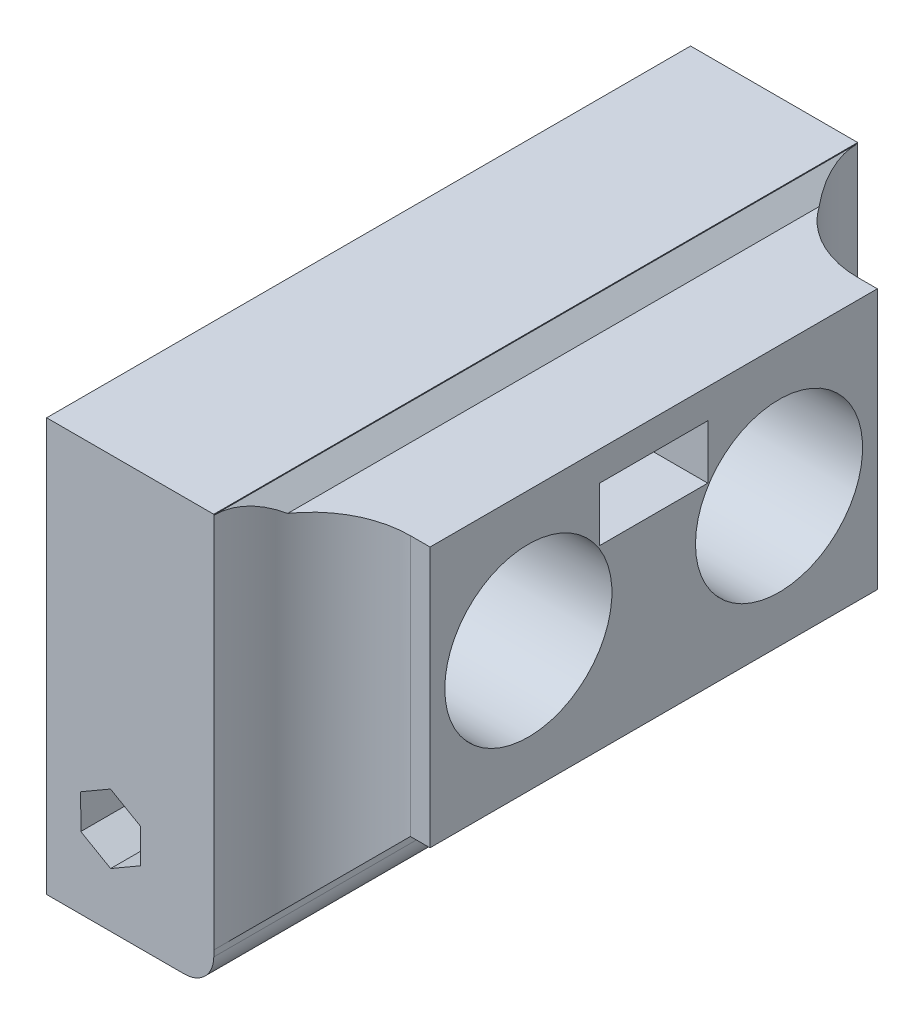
ISO-10303-21;
HEADER;
FILE_DESCRIPTION(('STEP AP214'),'2;1');
FILE_NAME('part.step','',(''),(''),'','','');
FILE_SCHEMA(('AUTOMOTIVE_DESIGN { 1 0 10303 214 1 1 1 1 }'));
ENDSEC;
DATA;
#1=APPLICATION_CONTEXT('core data for automotive mechanical design processes');
#2=APPLICATION_PROTOCOL_DEFINITION('international standard','automotive_design',2000,#1);
#3=PRODUCT_CONTEXT('',#1,'mechanical');
#4=PRODUCT('Part','Part','',(#3));
#5=PRODUCT_RELATED_PRODUCT_CATEGORY('part','',(#4));
#6=PRODUCT_DEFINITION_FORMATION('','',#4);
#7=PRODUCT_DEFINITION_CONTEXT('part definition',#1,'design');
#8=PRODUCT_DEFINITION('design','',#6,#7);
#9=PRODUCT_DEFINITION_SHAPE('','',#8);
#10=(LENGTH_UNIT() NAMED_UNIT(*) SI_UNIT(.MILLI.,.METRE.));
#11=(NAMED_UNIT(*) PLANE_ANGLE_UNIT() SI_UNIT($,.RADIAN.));
#12=(NAMED_UNIT(*) SI_UNIT($,.STERADIAN.) SOLID_ANGLE_UNIT());
#13=UNCERTAINTY_MEASURE_WITH_UNIT(LENGTH_MEASURE(1.E-05),#10,'distance_accuracy_value','');
#14=(GEOMETRIC_REPRESENTATION_CONTEXT(3) GLOBAL_UNCERTAINTY_ASSIGNED_CONTEXT((#13)) GLOBAL_UNIT_ASSIGNED_CONTEXT((#10,
#11,#12)) REPRESENTATION_CONTEXT('',''));
#15=CARTESIAN_POINT('',(0.,0.,0.));
#16=DIRECTION('',(0.,0.,1.));
#17=DIRECTION('',(1.,0.,0.));
#18=AXIS2_PLACEMENT_3D('',#15,#16,#17);
#19=CARTESIAN_POINT('',(-8.5,-7.57140846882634,-109.25));
#20=DIRECTION('',(0.,0.,1.));
#21=DIRECTION('',(1.,0.,0.));
#22=AXIS2_PLACEMENT_3D('',#19,#20,#21);
#23=CYLINDRICAL_SURFACE('',#22,1.75);
#24=CARTESIAN_POINT('',(-8.5,-7.57140846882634,1.25));
#25=DIRECTION('',(0.,0.,-1.));
#26=DIRECTION('',(-1.,0.,0.));
#27=AXIS2_PLACEMENT_3D('',#24,#25,#26);
#28=CIRCLE('',#27,1.75);
#29=CARTESIAN_POINT('',(-10.25,-7.57140846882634,1.25));
#30=VERTEX_POINT('',#29);
#31=EDGE_CURVE('E391',#30,#30,#28,.T.);
#32=ORIENTED_EDGE('',*,*,#31,.T.);
#33=EDGE_LOOP('',(#32));
#34=FACE_BOUND('',#33,.T.);
#35=CARTESIAN_POINT('',(-8.5,-7.57140846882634,5.));
#36=DIRECTION('',(0.,0.,1.));
#37=DIRECTION('',(1.,0.,0.));
#38=AXIS2_PLACEMENT_3D('',#35,#36,#37);
#39=CIRCLE('',#38,1.75);
#40=CARTESIAN_POINT('',(-6.75,-7.57140846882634,5.));
#41=VERTEX_POINT('',#40);
#42=EDGE_CURVE('E381',#41,#41,#39,.F.);
#43=ORIENTED_EDGE('',*,*,#42,.F.);
#44=EDGE_LOOP('',(#43));
#45=FACE_BOUND('',#44,.T.);
#46=ADVANCED_FACE('F47',(#34,#45),#23,.F.);
#47=CARTESIAN_POINT('',(-8.5,-7.57140846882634,-46.75));
#48=DIRECTION('',(0.,0.,-1.));
#49=DIRECTION('',(-1.,0.,0.));
#50=AXIS2_PLACEMENT_3D('',#47,#48,#49);
#51=CIRCLE('',#50,1.75);
#52=CARTESIAN_POINT('',(-10.25,-7.57140846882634,-46.75));
#53=VERTEX_POINT('',#52);
#54=EDGE_CURVE('E396',#53,#53,#51,.T.);
#55=ORIENTED_EDGE('',*,*,#54,.F.);
#56=EDGE_LOOP('',(#55));
#57=FACE_BOUND('',#56,.T.);
#58=CARTESIAN_POINT('',(-8.5,-7.57140846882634,-50.5));
#59=DIRECTION('',(0.,0.,-1.));
#60=DIRECTION('',(-1.,0.,0.));
#61=AXIS2_PLACEMENT_3D('',#58,#59,#60);
#62=CIRCLE('',#61,1.75);
#63=CARTESIAN_POINT('',(-10.25,-7.57140846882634,-50.5));
#64=VERTEX_POINT('',#63);
#65=EDGE_CURVE('E387',#64,#64,#62,.F.);
#66=ORIENTED_EDGE('',*,*,#65,.F.);
#67=EDGE_LOOP('',(#66));
#68=FACE_BOUND('',#67,.T.);
#69=ADVANCED_FACE('F560',(#57,#68),#23,.F.);
#70=CARTESIAN_POINT('',(0.,0.,0.));
#71=DIRECTION('',(1.,0.,0.));
#72=DIRECTION('',(0.,0.,-1.));
#73=AXIS2_PLACEMENT_3D('',#70,#71,#72);
#74=PLANE('',#73);
#75=DIRECTION('',(0.,1.,0.));
#76=VECTOR('',#75,1.);
#77=CARTESIAN_POINT('',(0.,0.,-17.25));
#78=LINE('',#77,#76);
#79=CARTESIAN_POINT('',(0.,0.,-17.25));
#80=VERTEX_POINT('',#79);
#81=CARTESIAN_POINT('',(0.,5.,-17.25));
#82=VERTEX_POINT('',#81);
#83=EDGE_CURVE('E1331',#80,#82,#78,.T.);
#84=ORIENTED_EDGE('',*,*,#83,.F.);
#85=DIRECTION('',(0.,0.,-1.));
#86=VECTOR('',#85,1.);
#87=CARTESIAN_POINT('',(0.,0.,-45.5));
#88=LINE('',#87,#86);
#89=CARTESIAN_POINT('',(0.,0.,-28.25));
#90=VERTEX_POINT('',#89);
#91=EDGE_CURVE('E1396',#80,#90,#88,.T.);
#92=ORIENTED_EDGE('',*,*,#91,.T.);
#93=DIRECTION('',(0.,1.,0.));
#94=VECTOR('',#93,1.);
#95=CARTESIAN_POINT('',(0.,0.,-28.25));
#96=LINE('',#95,#94);
#97=CARTESIAN_POINT('',(0.,5.,-28.25));
#98=VERTEX_POINT('',#97);
#99=EDGE_CURVE('E1344',#90,#98,#96,.T.);
#100=ORIENTED_EDGE('',*,*,#99,.T.);
#101=DIRECTION('',(0.,0.,-1.));
#102=VECTOR('',#101,1.);
#103=CARTESIAN_POINT('',(0.,5.,0.));
#104=LINE('',#103,#102);
#105=EDGE_CURVE('E1326',#82,#98,#104,.T.);
#106=ORIENTED_EDGE('',*,*,#105,.F.);
#107=EDGE_LOOP('',(#84,#92,#100,#106));
#108=FACE_BOUND('',#107,.T.);
#109=DIRECTION('',(0.,0.,-1.));
#110=VECTOR('',#109,1.);
#111=CARTESIAN_POINT('',(0.,20.5,0.));
#112=LINE('',#111,#110);
#113=CARTESIAN_POINT('',(0.,20.5,-17.25));
#114=VERTEX_POINT('',#113);
#115=CARTESIAN_POINT('',(0.,20.5,-28.25));
#116=VERTEX_POINT('',#115);
#117=EDGE_CURVE('E1389',#114,#116,#112,.T.);
#118=ORIENTED_EDGE('',*,*,#117,.F.);
#119=DIRECTION('',(0.,-1.,0.));
#120=VECTOR('',#119,1.);
#121=CARTESIAN_POINT('',(0.,0.,-17.25));
#122=LINE('',#121,#120);
#123=CARTESIAN_POINT('',(0.,15.,-17.25));
#124=VERTEX_POINT('',#123);
#125=EDGE_CURVE('E1335',#114,#124,#122,.T.);
#126=ORIENTED_EDGE('',*,*,#125,.T.);
#127=DIRECTION('',(0.,0.,-1.));
#128=VECTOR('',#127,1.);
#129=CARTESIAN_POINT('',(0.,15.,0.));
#130=LINE('',#129,#128);
#131=CARTESIAN_POINT('',(0.,15.,-28.25));
#132=VERTEX_POINT('',#131);
#133=EDGE_CURVE('E1339',#124,#132,#130,.T.);
#134=ORIENTED_EDGE('',*,*,#133,.T.);
#135=DIRECTION('',(0.,-1.,0.));
#136=VECTOR('',#135,1.);
#137=CARTESIAN_POINT('',(0.,0.,-28.25));
#138=LINE('',#137,#136);
#139=EDGE_CURVE('E358',#116,#132,#138,.T.);
#140=ORIENTED_EDGE('',*,*,#139,.F.);
#141=EDGE_LOOP('',(#118,#126,#134,#140));
#142=FACE_BOUND('',#141,.T.);
#143=CARTESIAN_POINT('',(0.,10.25,-35.5));
#144=DIRECTION('',(1.,0.,0.));
#145=DIRECTION('',(0.,0.,-1.));
#146=AXIS2_PLACEMENT_3D('',#143,#144,#145);
#147=CIRCLE('',#146,8.5);
#148=CARTESIAN_POINT('',(0.,10.25,-27.));
#149=VERTEX_POINT('',#148);
#150=EDGE_CURVE('E1352',#149,#149,#147,.T.);
#151=ORIENTED_EDGE('',*,*,#150,.T.);
#152=EDGE_LOOP('',(#151));
#153=FACE_BOUND('',#152,.T.);
#154=CARTESIAN_POINT('',(0.,10.25,-10.));
#155=DIRECTION('',(1.,0.,0.));
#156=DIRECTION('',(0.,0.,-1.));
#157=AXIS2_PLACEMENT_3D('',#154,#155,#156);
#158=CIRCLE('',#157,8.5);
#159=CARTESIAN_POINT('',(0.,10.25,-1.5));
#160=VERTEX_POINT('',#159);
#161=EDGE_CURVE('E1348',#160,#160,#158,.T.);
#162=ORIENTED_EDGE('',*,*,#161,.T.);
#163=EDGE_LOOP('',(#162));
#164=FACE_BOUND('',#163,.T.);
#165=DIRECTION('',(0.,0.,1.));
#166=VECTOR('',#165,1.);
#167=CARTESIAN_POINT('',(0.,-1.82140846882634,1.25000000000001));
#168=LINE('',#167,#166);
#169=CARTESIAN_POINT('',(0.,-1.82140846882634,1.25000000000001));
#170=VERTEX_POINT('',#169);
#171=CARTESIAN_POINT('',(0.,-1.82140846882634,7.25000000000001));
#172=VERTEX_POINT('',#171);
#173=EDGE_CURVE('E1506',#170,#172,#168,.T.);
#174=ORIENTED_EDGE('',*,*,#173,.T.);
#175=DIRECTION('',(0.,1.,0.));
#176=VECTOR('',#175,1.);
#177=CARTESIAN_POINT('',(0.,23.5,7.25000000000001));
#178=LINE('',#177,#176);
#179=CARTESIAN_POINT('',(0.,23.5,7.25000000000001));
#180=VERTEX_POINT('',#179);
#181=EDGE_CURVE('E1457',#172,#180,#178,.T.);
#182=ORIENTED_EDGE('',*,*,#181,.T.);
#183=DIRECTION('',(0.,0.,-1.));
#184=VECTOR('',#183,1.);
#185=CARTESIAN_POINT('',(0.,23.5,-52.75));
#186=LINE('',#185,#184);
#187=CARTESIAN_POINT('',(0.,23.5,-52.75));
#188=VERTEX_POINT('',#187);
#189=EDGE_CURVE('E1452',#180,#188,#186,.T.);
#190=ORIENTED_EDGE('',*,*,#189,.T.);
#191=DIRECTION('',(0.,-1.,0.));
#192=VECTOR('',#191,1.);
#193=CARTESIAN_POINT('',(0.,23.5,-52.75));
#194=LINE('',#193,#192);
#195=CARTESIAN_POINT('',(0.,-1.82140846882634,-52.75));
#196=VERTEX_POINT('',#195);
#197=EDGE_CURVE('E1464',#188,#196,#194,.T.);
#198=ORIENTED_EDGE('',*,*,#197,.T.);
#199=DIRECTION('',(0.,0.,-1.));
#200=VECTOR('',#199,1.);
#201=CARTESIAN_POINT('',(0.,-1.82140846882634,-46.75));
#202=LINE('',#201,#200);
#203=CARTESIAN_POINT('',(0.,-1.82140846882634,-46.75));
#204=VERTEX_POINT('',#203);
#205=EDGE_CURVE('E1468',#204,#196,#202,.T.);
#206=ORIENTED_EDGE('',*,*,#205,.F.);
#207=DIRECTION('',(0.,1.,0.));
#208=VECTOR('',#207,1.);
#209=CARTESIAN_POINT('',(0.,-1.82140846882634,-46.75));
#210=LINE('',#209,#208);
#211=CARTESIAN_POINT('',(0.,-14.8214084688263,-46.75));
#212=VERTEX_POINT('',#211);
#213=EDGE_CURVE('E1491',#212,#204,#210,.T.);
#214=ORIENTED_EDGE('',*,*,#213,.F.);
#215=DIRECTION('',(0.,0.,1.));
#216=VECTOR('',#215,1.);
#217=CARTESIAN_POINT('',(0.,-14.8214084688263,-52.75));
#218=LINE('',#217,#216);
#219=CARTESIAN_POINT('',(0.,-14.8214084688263,1.25000000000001));
#220=VERTEX_POINT('',#219);
#221=EDGE_CURVE('E1460',#212,#220,#218,.T.);
#222=ORIENTED_EDGE('',*,*,#221,.T.);
#223=DIRECTION('',(0.,-1.,0.));
#224=VECTOR('',#223,1.);
#225=CARTESIAN_POINT('',(0.,-1.82140846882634,1.25000000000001));
#226=LINE('',#225,#224);
#227=EDGE_CURVE('E1514',#170,#220,#226,.T.);
#228=ORIENTED_EDGE('',*,*,#227,.F.);
#229=EDGE_LOOP('',(#174,#182,#190,#198,#206,#214,#222,#228));
#230=FACE_BOUND('',#229,.T.);
#231=ADVANCED_FACE('F566',(#108,#142,#153,#164,#230),#74,.F.);
#232=CARTESIAN_POINT('',(-15.,23.5,7.25000000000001));
#233=DIRECTION('',(0.,0.,-1.));
#234=DIRECTION('',(-1.,0.,0.));
#235=AXIS2_PLACEMENT_3D('',#232,#233,#234);
#236=PLANE('',#235);
#237=ORIENTED_EDGE('',*,*,#181,.F.);
#238=DIRECTION('',(1.,0.,0.));
#239=VECTOR('',#238,1.);
#240=CARTESIAN_POINT('',(0.,-1.82140846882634,7.25000000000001));
#241=LINE('',#240,#239);
#242=CARTESIAN_POINT('',(-15.,-1.82140846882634,7.25000000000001));
#243=VERTEX_POINT('',#242);
#244=EDGE_CURVE('E1511',#243,#172,#241,.T.);
#245=ORIENTED_EDGE('',*,*,#244,.F.);
#246=DIRECTION('',(0.,1.,0.));
#247=VECTOR('',#246,1.);
#248=CARTESIAN_POINT('',(-15.,23.5,7.25000000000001));
#249=LINE('',#248,#247);
#250=CARTESIAN_POINT('',(-15.,23.5,7.25000000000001));
#251=VERTEX_POINT('',#250);
#252=EDGE_CURVE('E1471',#243,#251,#249,.T.);
#253=ORIENTED_EDGE('',*,*,#252,.T.);
#254=DIRECTION('',(1.,0.,0.));
#255=VECTOR('',#254,1.);
#256=CARTESIAN_POINT('',(-15.,23.5,7.25000000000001));
#257=LINE('',#256,#255);
#258=EDGE_CURVE('E1444',#251,#180,#257,.T.);
#259=ORIENTED_EDGE('',*,*,#258,.T.);
#260=EDGE_LOOP('',(#237,#245,#253,#259));
#261=FACE_BOUND('',#260,.T.);
#262=ADVANCED_FACE('F597',(#261),#236,.T.);
#263=CARTESIAN_POINT('',(-15.,23.5,-52.75));
#264=DIRECTION('',(0.,0.,1.));
#265=DIRECTION('',(1.,0.,0.));
#266=AXIS2_PLACEMENT_3D('',#263,#264,#265);
#267=PLANE('',#266);
#268=DIRECTION('',(0.,-1.,0.));
#269=VECTOR('',#268,1.);
#270=CARTESIAN_POINT('',(-15.,23.5,-52.75));
#271=LINE('',#270,#269);
#272=CARTESIAN_POINT('',(-15.,23.5,-52.75));
#273=VERTEX_POINT('',#272);
#274=CARTESIAN_POINT('',(-15.,-1.82140846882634,-52.75));
#275=VERTEX_POINT('',#274);
#276=EDGE_CURVE('E1456',#273,#275,#271,.T.);
#277=ORIENTED_EDGE('',*,*,#276,.T.);
#278=DIRECTION('',(-1.,0.,0.));
#279=VECTOR('',#278,1.);
#280=CARTESIAN_POINT('',(0.,-1.82140846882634,-52.75));
#281=LINE('',#280,#279);
#282=EDGE_CURVE('E1488',#196,#275,#281,.T.);
#283=ORIENTED_EDGE('',*,*,#282,.F.);
#284=ORIENTED_EDGE('',*,*,#197,.F.);
#285=DIRECTION('',(1.,0.,0.));
#286=VECTOR('',#285,1.);
#287=CARTESIAN_POINT('',(-15.,23.5,-52.75));
#288=LINE('',#287,#286);
#289=EDGE_CURVE('E1448',#273,#188,#288,.T.);
#290=ORIENTED_EDGE('',*,*,#289,.F.);
#291=EDGE_LOOP('',(#277,#283,#284,#290));
#292=FACE_BOUND('',#291,.T.);
#293=ADVANCED_FACE('F600',(#292),#267,.T.);
#294=CARTESIAN_POINT('',(-15.,-14.8214084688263,-52.75));
#295=DIRECTION('',(0.,1.,0.));
#296=DIRECTION('',(0.,0.,1.));
#297=AXIS2_PLACEMENT_3D('',#294,#295,#296);
#298=PLANE('',#297);
#299=DIRECTION('',(0.,0.,-1.));
#300=VECTOR('',#299,1.);
#301=CARTESIAN_POINT('',(-5.02175712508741,-14.8214084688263,-17.75));
#302=LINE('',#301,#300);
#303=CARTESIAN_POINT('',(-5.02175712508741,-14.8214084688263,-28.75));
#304=VERTEX_POINT('',#303);
#305=CARTESIAN_POINT('',(-5.02175712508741,-14.8214084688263,-16.75));
#306=VERTEX_POINT('',#305);
#307=EDGE_CURVE('E548',#304,#306,#302,.F.);
#308=ORIENTED_EDGE('',*,*,#307,.T.);
#309=DIRECTION('',(1.,0.,0.));
#310=VECTOR('',#309,1.);
#311=CARTESIAN_POINT('',(-10.,-14.8214084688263,-16.75));
#312=LINE('',#311,#310);
#313=CARTESIAN_POINT('',(-10.,-14.8214084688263,-16.75));
#314=VERTEX_POINT('',#313);
#315=EDGE_CURVE('E498',#306,#314,#312,.F.);
#316=ORIENTED_EDGE('',*,*,#315,.T.);
#317=DIRECTION('',(0.,0.,1.));
#318=VECTOR('',#317,1.);
#319=CARTESIAN_POINT('',(-9.99999999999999,-14.8214084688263,-52.75));
#320=LINE('',#319,#318);
#321=CARTESIAN_POINT('',(-9.99999999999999,-14.8214084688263,-28.75));
#322=VERTEX_POINT('',#321);
#323=EDGE_CURVE('E513',#322,#314,#320,.T.);
#324=ORIENTED_EDGE('',*,*,#323,.F.);
#325=DIRECTION('',(-1.,0.,0.));
#326=VECTOR('',#325,1.);
#327=CARTESIAN_POINT('',(-5.02175712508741,-14.8214084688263,-28.75));
#328=LINE('',#327,#326);
#329=EDGE_CURVE('E743',#322,#304,#328,.F.);
#330=ORIENTED_EDGE('',*,*,#329,.T.);
#331=EDGE_LOOP('',(#308,#316,#324,#330));
#332=FACE_BOUND('',#331,.T.);
#333=DIRECTION('',(-1.,0.,0.));
#334=VECTOR('',#333,1.);
#335=CARTESIAN_POINT('',(0.,-14.8214084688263,1.25000000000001));
#336=LINE('',#335,#334);
#337=CARTESIAN_POINT('',(-15.,-14.8214084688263,1.25000000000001));
#338=VERTEX_POINT('',#337);
#339=EDGE_CURVE('E1520',#220,#338,#336,.T.);
#340=ORIENTED_EDGE('',*,*,#339,.F.);
#341=ORIENTED_EDGE('',*,*,#221,.F.);
#342=DIRECTION('',(1.,0.,0.));
#343=VECTOR('',#342,1.);
#344=CARTESIAN_POINT('',(0.,-14.8214084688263,-46.75));
#345=LINE('',#344,#343);
#346=CARTESIAN_POINT('',(-15.,-14.8214084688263,-46.75));
#347=VERTEX_POINT('',#346);
#348=EDGE_CURVE('E1487',#347,#212,#345,.T.);
#349=ORIENTED_EDGE('',*,*,#348,.F.);
#350=DIRECTION('',(0.,0.,1.));
#351=VECTOR('',#350,1.);
#352=CARTESIAN_POINT('',(-15.,-14.8214084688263,-52.75));
#353=LINE('',#352,#351);
#354=EDGE_CURVE('E1474',#347,#338,#353,.T.);
#355=ORIENTED_EDGE('',*,*,#354,.T.);
#356=EDGE_LOOP('',(#340,#341,#349,#355));
#357=FACE_BOUND('',#356,.T.);
#358=ADVANCED_FACE('F544',(#332,#357),#298,.T.);
#359=CARTESIAN_POINT('',(2.,0.,0.));
#360=DIRECTION('',(-1.,0.,0.));
#361=DIRECTION('',(0.,0.,1.));
#362=AXIS2_PLACEMENT_3D('',#359,#360,#361);
#363=PLANE('',#362);
#364=DIRECTION('',(0.,1.,0.));
#365=VECTOR('',#364,1.);
#366=CARTESIAN_POINT('',(2.,25.3860544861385,10.));
#367=LINE('',#366,#365);
#368=CARTESIAN_POINT('',(2.,25.3,10.));
#369=VERTEX_POINT('',#368);
#370=CARTESIAN_POINT('',(2.,25.3860544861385,10.));
#371=VERTEX_POINT('',#370);
#372=EDGE_CURVE('E1261',#369,#371,#367,.T.);
#373=ORIENTED_EDGE('',*,*,#372,.F.);
#374=DIRECTION('',(0.,0.,-1.));
#375=VECTOR('',#374,1.);
#376=CARTESIAN_POINT('',(2.,25.3,0.));
#377=LINE('',#376,#375);
#378=CARTESIAN_POINT('',(2.,25.3,-55.5));
#379=VERTEX_POINT('',#378);
#380=EDGE_CURVE('E716',#369,#379,#377,.T.);
#381=ORIENTED_EDGE('',*,*,#380,.T.);
#382=DIRECTION('',(0.,-1.,0.));
#383=VECTOR('',#382,1.);
#384=CARTESIAN_POINT('',(2.,25.3860544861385,-55.5));
#385=LINE('',#384,#383);
#386=CARTESIAN_POINT('',(2.,25.3860544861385,-55.5));
#387=VERTEX_POINT('',#386);
#388=EDGE_CURVE('E1270',#387,#379,#385,.T.);
#389=ORIENTED_EDGE('',*,*,#388,.F.);
#390=DIRECTION('',(0.,0.,-1.));
#391=VECTOR('',#390,1.);
#392=CARTESIAN_POINT('',(2.,25.3860544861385,-55.5));
#393=LINE('',#392,#391);
#394=EDGE_CURVE('E1266',#371,#387,#393,.T.);
#395=ORIENTED_EDGE('',*,*,#394,.F.);
#396=EDGE_LOOP('',(#373,#381,#389,#395));
#397=FACE_BOUND('',#396,.T.);
#398=ADVANCED_FACE('F604',(#397),#363,.F.);
#399=CARTESIAN_POINT('',(14.,0.,-45.5));
#400=DIRECTION('',(0.,0.,1.));
#401=DIRECTION('',(1.,0.,0.));
#402=AXIS2_PLACEMENT_3D('',#399,#400,#401);
#403=PLANE('',#402);
#404=DIRECTION('',(1.,0.,0.));
#405=VECTOR('',#404,1.);
#406=CARTESIAN_POINT('',(0.,-3.,-45.5));
#407=LINE('',#406,#405);
#408=CARTESIAN_POINT('',(11.9999999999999,-3.,-45.5));
#409=VERTEX_POINT('',#408);
#410=CARTESIAN_POINT('',(14.,-3.,-45.5));
#411=VERTEX_POINT('',#410);
#412=EDGE_CURVE('E1400',#409,#411,#407,.T.);
#413=ORIENTED_EDGE('',*,*,#412,.F.);
#414=DIRECTION('',(0.,-1.,0.));
#415=VECTOR('',#414,1.);
#416=CARTESIAN_POINT('',(12.,23.5,-45.5));
#417=LINE('',#416,#415);
#418=CARTESIAN_POINT('',(12.,23.5,-45.5));
#419=VERTEX_POINT('',#418);
#420=EDGE_CURVE('E1292',#409,#419,#417,.F.);
#421=ORIENTED_EDGE('',*,*,#420,.T.);
#422=DIRECTION('',(-1.,0.,0.));
#423=VECTOR('',#422,1.);
#424=CARTESIAN_POINT('',(14.,23.5,-45.5));
#425=LINE('',#424,#423);
#426=CARTESIAN_POINT('',(14.,23.5,-45.5));
#427=VERTEX_POINT('',#426);
#428=EDGE_CURVE('E1286',#427,#419,#425,.T.);
#429=ORIENTED_EDGE('',*,*,#428,.F.);
#430=DIRECTION('',(0.,1.,0.));
#431=VECTOR('',#430,1.);
#432=CARTESIAN_POINT('',(14.,0.,-45.5));
#433=LINE('',#432,#431);
#434=EDGE_CURVE('E1359',#411,#427,#433,.T.);
#435=ORIENTED_EDGE('',*,*,#434,.F.);
#436=EDGE_LOOP('',(#413,#421,#429,#435));
#437=FACE_BOUND('',#436,.T.);
#438=ADVANCED_FACE('F666',(#437),#403,.F.);
#439=CARTESIAN_POINT('',(14.,0.,0.));
#440=DIRECTION('',(0.,0.,1.));
#441=DIRECTION('',(1.,0.,0.));
#442=AXIS2_PLACEMENT_3D('',#439,#440,#441);
#443=PLANE('',#442);
#444=DIRECTION('',(-1.,0.,0.));
#445=VECTOR('',#444,1.);
#446=CARTESIAN_POINT('',(14.,23.5,0.));
#447=LINE('',#446,#445);
#448=CARTESIAN_POINT('',(14.,23.5,0.));
#449=VERTEX_POINT('',#448);
#450=CARTESIAN_POINT('',(12.,23.5,0.));
#451=VERTEX_POINT('',#450);
#452=EDGE_CURVE('E1384',#449,#451,#447,.T.);
#453=ORIENTED_EDGE('',*,*,#452,.T.);
#454=DIRECTION('',(0.,1.,0.));
#455=VECTOR('',#454,1.);
#456=CARTESIAN_POINT('',(12.,0.,0.));
#457=LINE('',#456,#455);
#458=CARTESIAN_POINT('',(11.9999999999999,-3.,0.));
#459=VERTEX_POINT('',#458);
#460=EDGE_CURVE('E711',#451,#459,#457,.F.);
#461=ORIENTED_EDGE('',*,*,#460,.T.);
#462=DIRECTION('',(-1.,0.,0.));
#463=VECTOR('',#462,1.);
#464=CARTESIAN_POINT('',(0.,-3.,0.));
#465=LINE('',#464,#463);
#466=CARTESIAN_POINT('',(14.,-3.,0.));
#467=VERTEX_POINT('',#466);
#468=EDGE_CURVE('E1393',#467,#459,#465,.T.);
#469=ORIENTED_EDGE('',*,*,#468,.F.);
#470=DIRECTION('',(0.,1.,0.));
#471=VECTOR('',#470,1.);
#472=CARTESIAN_POINT('',(14.,0.,0.));
#473=LINE('',#472,#471);
#474=EDGE_CURVE('E1325',#467,#449,#473,.T.);
#475=ORIENTED_EDGE('',*,*,#474,.T.);
#476=EDGE_LOOP('',(#453,#461,#469,#475));
#477=FACE_BOUND('',#476,.T.);
#478=ADVANCED_FACE('F642',(#477),#443,.T.);
#479=CARTESIAN_POINT('',(14.,23.5,0.));
#480=DIRECTION('',(0.,1.,0.));
#481=DIRECTION('',(0.,0.,1.));
#482=AXIS2_PLACEMENT_3D('',#479,#480,#481);
#483=PLANE('',#482);
#484=CARTESIAN_POINT('',(12.,23.5,-55.5));
#485=DIRECTION('',(0.,1.,0.));
#486=DIRECTION('',(0.,0.,1.));
#487=AXIS2_PLACEMENT_3D('',#484,#485,#486);
#488=CIRCLE('',#487,10.);
#489=CARTESIAN_POINT('',(3.79999999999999,23.5,-49.7763647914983));
#490=VERTEX_POINT('',#489);
#491=EDGE_CURVE('E1279',#419,#490,#488,.F.);
#492=ORIENTED_EDGE('',*,*,#491,.T.);
#493=DIRECTION('',(0.,0.,1.));
#494=VECTOR('',#493,1.);
#495=CARTESIAN_POINT('',(3.8,23.5,0.));
#496=LINE('',#495,#494);
#497=CARTESIAN_POINT('',(3.79999999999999,23.5,4.27636479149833));
#498=VERTEX_POINT('',#497);
#499=EDGE_CURVE('E722',#490,#498,#496,.T.);
#500=ORIENTED_EDGE('',*,*,#499,.T.);
#501=CARTESIAN_POINT('',(12.,23.5,10.));
#502=DIRECTION('',(0.,1.,0.));
#503=DIRECTION('',(0.,0.,1.));
#504=AXIS2_PLACEMENT_3D('',#501,#502,#503);
#505=CIRCLE('',#504,10.);
#506=EDGE_CURVE('E717',#498,#451,#505,.F.);
#507=ORIENTED_EDGE('',*,*,#506,.T.);
#508=ORIENTED_EDGE('',*,*,#452,.F.);
#509=DIRECTION('',(0.,0.,-1.));
#510=VECTOR('',#509,1.);
#511=CARTESIAN_POINT('',(14.,23.5,0.));
#512=LINE('',#511,#510);
#513=EDGE_CURVE('E1388',#449,#427,#512,.T.);
#514=ORIENTED_EDGE('',*,*,#513,.T.);
#515=ORIENTED_EDGE('',*,*,#428,.T.);
#516=EDGE_LOOP('',(#492,#500,#507,#508,#514,#515));
#517=FACE_BOUND('',#516,.T.);
#518=ADVANCED_FACE('F634',(#517),#483,.T.);
#519=CARTESIAN_POINT('',(0.,-3.,0.));
#520=DIRECTION('',(0.,1.,0.));
#521=DIRECTION('',(0.,0.,1.));
#522=AXIS2_PLACEMENT_3D('',#519,#520,#521);
#523=PLANE('',#522);
#524=ORIENTED_EDGE('',*,*,#468,.T.);
#525=DIRECTION('',(0.,0.,-1.));
#526=VECTOR('',#525,1.);
#527=CARTESIAN_POINT('',(12.,-3.,-45.5));
#528=LINE('',#527,#526);
#529=EDGE_CURVE('E1297',#459,#409,#528,.T.);
#530=ORIENTED_EDGE('',*,*,#529,.T.);
#531=ORIENTED_EDGE('',*,*,#412,.T.);
#532=DIRECTION('',(0.,0.,1.));
#533=VECTOR('',#532,1.);
#534=CARTESIAN_POINT('',(14.,-3.,-45.5));
#535=LINE('',#534,#533);
#536=EDGE_CURVE('E1405',#411,#467,#535,.T.);
#537=ORIENTED_EDGE('',*,*,#536,.T.);
#538=EDGE_LOOP('',(#524,#530,#531,#537));
#539=FACE_BOUND('',#538,.T.);
#540=ADVANCED_FACE('F630',(#539),#523,.F.);
#541=CARTESIAN_POINT('',(14.,0.,-28.25));
#542=DIRECTION('',(0.,0.,1.));
#543=DIRECTION('',(1.,0.,0.));
#544=AXIS2_PLACEMENT_3D('',#541,#542,#543);
#545=PLANE('',#544);
#546=DIRECTION('',(-1.,0.,0.));
#547=VECTOR('',#546,1.);
#548=CARTESIAN_POINT('',(14.,0.,-28.25));
#549=LINE('',#548,#547);
#550=CARTESIAN_POINT('',(7.,0.,-28.25));
#551=VERTEX_POINT('',#550);
#552=EDGE_CURVE('E1305',#551,#90,#549,.T.);
#553=ORIENTED_EDGE('',*,*,#552,.F.);
#554=DIRECTION('',(0.,1.,0.));
#555=VECTOR('',#554,1.);
#556=CARTESIAN_POINT('',(7.,0.,-28.25));
#557=LINE('',#556,#555);
#558=CARTESIAN_POINT('',(7.,5.,-28.25));
#559=VERTEX_POINT('',#558);
#560=EDGE_CURVE('E1356',#551,#559,#557,.T.);
#561=ORIENTED_EDGE('',*,*,#560,.T.);
#562=DIRECTION('',(-1.,0.,0.));
#563=VECTOR('',#562,1.);
#564=CARTESIAN_POINT('',(14.,5.,-28.25));
#565=LINE('',#564,#563);
#566=EDGE_CURVE('E1322',#559,#98,#565,.T.);
#567=ORIENTED_EDGE('',*,*,#566,.T.);
#568=ORIENTED_EDGE('',*,*,#99,.F.);
#569=EDGE_LOOP('',(#553,#561,#567,#568));
#570=FACE_BOUND('',#569,.T.);
#571=ADVANCED_FACE('F633',(#570),#545,.T.);
#572=CARTESIAN_POINT('',(14.,0.,-17.25));
#573=DIRECTION('',(0.,0.,1.));
#574=DIRECTION('',(1.,0.,0.));
#575=AXIS2_PLACEMENT_3D('',#572,#573,#574);
#576=PLANE('',#575);
#577=DIRECTION('',(0.,1.,0.));
#578=VECTOR('',#577,1.);
#579=CARTESIAN_POINT('',(7.,0.,-17.25));
#580=LINE('',#579,#578);
#581=CARTESIAN_POINT('',(7.,0.,-17.25));
#582=VERTEX_POINT('',#581);
#583=CARTESIAN_POINT('',(7.,5.,-17.25));
#584=VERTEX_POINT('',#583);
#585=EDGE_CURVE('E1372',#582,#584,#580,.T.);
#586=ORIENTED_EDGE('',*,*,#585,.F.);
#587=DIRECTION('',(-1.,0.,0.));
#588=VECTOR('',#587,1.);
#589=CARTESIAN_POINT('',(14.,0.,-17.25));
#590=LINE('',#589,#588);
#591=EDGE_CURVE('E1316',#582,#80,#590,.T.);
#592=ORIENTED_EDGE('',*,*,#591,.T.);
#593=ORIENTED_EDGE('',*,*,#83,.T.);
#594=DIRECTION('',(-1.,0.,0.));
#595=VECTOR('',#594,1.);
#596=CARTESIAN_POINT('',(14.,5.,-17.25));
#597=LINE('',#596,#595);
#598=EDGE_CURVE('E1319',#584,#82,#597,.T.);
#599=ORIENTED_EDGE('',*,*,#598,.F.);
#600=EDGE_LOOP('',(#586,#592,#593,#599));
#601=FACE_BOUND('',#600,.T.);
#602=ADVANCED_FACE('F659',(#601),#576,.F.);
#603=CARTESIAN_POINT('',(14.,5.,0.));
#604=DIRECTION('',(0.,1.,0.));
#605=DIRECTION('',(0.,0.,1.));
#606=AXIS2_PLACEMENT_3D('',#603,#604,#605);
#607=PLANE('',#606);
#608=DIRECTION('',(0.,0.,-1.));
#609=VECTOR('',#608,1.);
#610=CARTESIAN_POINT('',(7.,5.,-17.25));
#611=LINE('',#610,#609);
#612=EDGE_CURVE('E1376',#584,#559,#611,.T.);
#613=ORIENTED_EDGE('',*,*,#612,.F.);
#614=ORIENTED_EDGE('',*,*,#598,.T.);
#615=ORIENTED_EDGE('',*,*,#105,.T.);
#616=ORIENTED_EDGE('',*,*,#566,.F.);
#617=EDGE_LOOP('',(#613,#614,#615,#616));
#618=FACE_BOUND('',#617,.T.);
#619=ADVANCED_FACE('F656',(#618),#607,.F.);
#620=CARTESIAN_POINT('',(14.,0.,-28.25));
#621=DIRECTION('',(0.,0.,-1.));
#622=DIRECTION('',(0.,1.,0.));
#623=AXIS2_PLACEMENT_3D('',#620,#621,#622);
#624=PLANE('',#623);
#625=DIRECTION('',(-1.,0.,0.));
#626=VECTOR('',#625,1.);
#627=CARTESIAN_POINT('',(14.,15.,-28.25));
#628=LINE('',#627,#626);
#629=CARTESIAN_POINT('',(14.,15.,-28.25));
#630=VERTEX_POINT('',#629);
#631=EDGE_CURVE('E353',#630,#132,#628,.T.);
#632=ORIENTED_EDGE('',*,*,#631,.F.);
#633=DIRECTION('',(0.,1.,0.));
#634=VECTOR('',#633,1.);
#635=CARTESIAN_POINT('',(14.,0.,-28.25));
#636=LINE('',#635,#634);
#637=CARTESIAN_POINT('',(14.,20.5,-28.25));
#638=VERTEX_POINT('',#637);
#639=EDGE_CURVE('E11',#630,#638,#636,.T.);
#640=ORIENTED_EDGE('',*,*,#639,.T.);
#641=DIRECTION('',(-1.,0.,0.));
#642=VECTOR('',#641,1.);
#643=CARTESIAN_POINT('',(14.,20.5,-28.25));
#644=LINE('',#643,#642);
#645=EDGE_CURVE('E361',#638,#116,#644,.T.);
#646=ORIENTED_EDGE('',*,*,#645,.T.);
#647=ORIENTED_EDGE('',*,*,#139,.T.);
#648=EDGE_LOOP('',(#632,#640,#646,#647));
#649=FACE_BOUND('',#648,.T.);
#650=ADVANCED_FACE('F354',(#649),#624,.F.);
#651=CARTESIAN_POINT('',(14.,15.,0.));
#652=DIRECTION('',(0.,1.,0.));
#653=DIRECTION('',(0.,0.,1.));
#654=AXIS2_PLACEMENT_3D('',#651,#652,#653);
#655=PLANE('',#654);
#656=DIRECTION('',(-1.,0.,0.));
#657=VECTOR('',#656,1.);
#658=CARTESIAN_POINT('',(14.,15.,-17.25));
#659=LINE('',#658,#657);
#660=CARTESIAN_POINT('',(14.,15.,-17.25));
#661=VERTEX_POINT('',#660);
#662=EDGE_CURVE('E63',#661,#124,#659,.T.);
#663=ORIENTED_EDGE('',*,*,#662,.F.);
#664=DIRECTION('',(0.,0.,-1.));
#665=VECTOR('',#664,1.);
#666=CARTESIAN_POINT('',(14.,15.,0.));
#667=LINE('',#666,#665);
#668=EDGE_CURVE('E364',#661,#630,#667,.T.);
#669=ORIENTED_EDGE('',*,*,#668,.T.);
#670=ORIENTED_EDGE('',*,*,#631,.T.);
#671=ORIENTED_EDGE('',*,*,#133,.F.);
#672=EDGE_LOOP('',(#663,#669,#670,#671));
#673=FACE_BOUND('',#672,.T.);
#674=ADVANCED_FACE('F365',(#673),#655,.T.);
#675=CARTESIAN_POINT('',(14.,0.,-17.25));
#676=DIRECTION('',(0.,0.,-1.));
#677=DIRECTION('',(-1.,0.,0.));
#678=AXIS2_PLACEMENT_3D('',#675,#676,#677);
#679=PLANE('',#678);
#680=DIRECTION('',(-1.,0.,0.));
#681=VECTOR('',#680,1.);
#682=CARTESIAN_POINT('',(14.,20.5,-17.25));
#683=LINE('',#682,#681);
#684=CARTESIAN_POINT('',(14.,20.5,-17.25));
#685=VERTEX_POINT('',#684);
#686=EDGE_CURVE('E1313',#685,#114,#683,.T.);
#687=ORIENTED_EDGE('',*,*,#686,.F.);
#688=DIRECTION('',(0.,-1.,0.));
#689=VECTOR('',#688,1.);
#690=CARTESIAN_POINT('',(14.,0.,-17.25));
#691=LINE('',#690,#689);
#692=EDGE_CURVE('E369',#685,#661,#691,.T.);
#693=ORIENTED_EDGE('',*,*,#692,.T.);
#694=ORIENTED_EDGE('',*,*,#662,.T.);
#695=ORIENTED_EDGE('',*,*,#125,.F.);
#696=EDGE_LOOP('',(#687,#693,#694,#695));
#697=FACE_BOUND('',#696,.T.);
#698=ADVANCED_FACE('F668',(#697),#679,.T.);
#699=CARTESIAN_POINT('',(14.,10.25,-10.));
#700=DIRECTION('',(-1.,0.,0.));
#701=DIRECTION('',(0.,0.,1.));
#702=AXIS2_PLACEMENT_3D('',#699,#700,#701);
#703=CYLINDRICAL_SURFACE('',#702,8.5);
#704=CARTESIAN_POINT('',(14.,10.25,-10.));
#705=DIRECTION('',(1.,0.,0.));
#706=DIRECTION('',(0.,0.,-1.));
#707=AXIS2_PLACEMENT_3D('',#704,#705,#706);
#708=CIRCLE('',#707,8.5);
#709=CARTESIAN_POINT('',(14.,10.25,-1.5));
#710=VERTEX_POINT('',#709);
#711=EDGE_CURVE('E1362',#710,#710,#708,.T.);
#712=CARTESIAN_POINT('',(14.,10.25,-1.5));
#713=CARTESIAN_POINT('',(13.8541666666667,10.25,-1.5));
#714=CARTESIAN_POINT('',(13.7083333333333,10.25,-1.5));
#715=CARTESIAN_POINT('',(13.4166666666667,10.25,-1.5));
#716=CARTESIAN_POINT('',(13.2708333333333,10.25,-1.5));
#717=CARTESIAN_POINT('',(12.9791666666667,10.25,-1.5));
#718=CARTESIAN_POINT('',(12.8333333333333,10.25,-1.5));
#719=CARTESIAN_POINT('',(12.5416666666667,10.25,-1.5));
#720=CARTESIAN_POINT('',(12.3958333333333,10.25,-1.5));
#721=CARTESIAN_POINT('',(12.1041666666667,10.25,-1.5));
#722=CARTESIAN_POINT('',(11.9583333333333,10.25,-1.5));
#723=CARTESIAN_POINT('',(11.6666666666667,10.25,-1.5));
#724=CARTESIAN_POINT('',(11.5208333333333,10.25,-1.5));
#725=CARTESIAN_POINT('',(11.2291666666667,10.25,-1.5));
#726=CARTESIAN_POINT('',(11.0833333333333,10.25,-1.5));
#727=CARTESIAN_POINT('',(10.7916666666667,10.25,-1.5));
#728=CARTESIAN_POINT('',(10.6458333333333,10.25,-1.5));
#729=CARTESIAN_POINT('',(10.3541666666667,10.25,-1.5));
#730=CARTESIAN_POINT('',(10.2083333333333,10.25,-1.5));
#731=CARTESIAN_POINT('',(9.91666666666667,10.25,-1.5));
#732=CARTESIAN_POINT('',(9.77083333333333,10.25,-1.5));
#733=CARTESIAN_POINT('',(9.47916666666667,10.25,-1.5));
#734=CARTESIAN_POINT('',(9.33333333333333,10.25,-1.5));
#735=CARTESIAN_POINT('',(9.04166666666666,10.25,-1.5));
#736=CARTESIAN_POINT('',(8.89583333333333,10.25,-1.5));
#737=CARTESIAN_POINT('',(8.60416666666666,10.25,-1.5));
#738=CARTESIAN_POINT('',(8.45833333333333,10.25,-1.5));
#739=CARTESIAN_POINT('',(8.16666666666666,10.25,-1.5));
#740=CARTESIAN_POINT('',(8.02083333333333,10.25,-1.5));
#741=CARTESIAN_POINT('',(7.72916666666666,10.25,-1.5));
#742=CARTESIAN_POINT('',(7.58333333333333,10.25,-1.5));
#743=CARTESIAN_POINT('',(7.29166666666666,10.25,-1.5));
#744=CARTESIAN_POINT('',(7.14583333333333,10.25,-1.5));
#745=CARTESIAN_POINT('',(6.85416666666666,10.25,-1.5));
#746=CARTESIAN_POINT('',(6.70833333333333,10.25,-1.5));
#747=CARTESIAN_POINT('',(6.41666666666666,10.25,-1.5));
#748=CARTESIAN_POINT('',(6.27083333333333,10.25,-1.5));
#749=CARTESIAN_POINT('',(5.97916666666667,10.25,-1.5));
#750=CARTESIAN_POINT('',(5.83333333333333,10.25,-1.5));
#751=CARTESIAN_POINT('',(5.54166666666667,10.25,-1.5));
#752=CARTESIAN_POINT('',(5.39583333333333,10.25,-1.5));
#753=CARTESIAN_POINT('',(5.10416666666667,10.25,-1.5));
#754=CARTESIAN_POINT('',(4.95833333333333,10.25,-1.5));
#755=CARTESIAN_POINT('',(4.66666666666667,10.25,-1.5));
#756=CARTESIAN_POINT('',(4.52083333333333,10.25,-1.5));
#757=CARTESIAN_POINT('',(4.22916666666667,10.25,-1.5));
#758=CARTESIAN_POINT('',(4.08333333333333,10.25,-1.5));
#759=CARTESIAN_POINT('',(3.79166666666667,10.25,-1.5));
#760=CARTESIAN_POINT('',(3.64583333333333,10.25,-1.5));
#761=CARTESIAN_POINT('',(3.35416666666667,10.25,-1.5));
#762=CARTESIAN_POINT('',(3.20833333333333,10.25,-1.5));
#763=CARTESIAN_POINT('',(2.91666666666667,10.25,-1.5));
#764=CARTESIAN_POINT('',(2.77083333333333,10.25,-1.5));
#765=CARTESIAN_POINT('',(2.47916666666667,10.25,-1.5));
#766=CARTESIAN_POINT('',(2.33333333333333,10.25,-1.5));
#767=CARTESIAN_POINT('',(2.04166666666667,10.25,-1.5));
#768=CARTESIAN_POINT('',(1.89583333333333,10.25,-1.5));
#769=CARTESIAN_POINT('',(1.60416666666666,10.25,-1.5));
#770=CARTESIAN_POINT('',(1.45833333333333,10.25,-1.5));
#771=CARTESIAN_POINT('',(1.16666666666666,10.25,-1.5));
#772=CARTESIAN_POINT('',(1.02083333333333,10.25,-1.5));
#773=CARTESIAN_POINT('',(0.729166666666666,10.25,-1.5));
#774=CARTESIAN_POINT('',(0.583333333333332,10.25,-1.5));
#775=CARTESIAN_POINT('',(0.291666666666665,10.25,-1.5));
#776=CARTESIAN_POINT('',(0.145833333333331,10.25,-1.5));
#777=CARTESIAN_POINT('',(0.,10.25,-1.5));
#778=B_SPLINE_CURVE_WITH_KNOTS('',3,(#712,#713,#714,#715,#716,#717,#718,#719,#720,#721,#722,
#723,#724,#725,#726,#727,#728,#729,#730,#731,#732,#733,#734,#735,#736,#737,#738,#739,#740,#741,
#742,#743,#744,#745,#746,#747,#748,#749,#750,#751,#752,#753,#754,#755,#756,#757,#758,#759,#760,
#761,#762,#763,#764,#765,#766,#767,#768,#769,#770,#771,#772,#773,#774,#775,#776,#777),
.UNSPECIFIED.,.F.,.F.,(4,2,2,2,2,2,2,2,2,2,2,2,2,2,2,2,2,2,2,2,2,2,2,2,2,2,2,2,2,2,2,2,4),(0.,
0.4375,0.875000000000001,1.3125,1.75,2.1875,2.625,3.0625,3.5,3.9375,4.375,4.8125,5.25,5.6875,
6.125,6.5625,7.,7.4375,7.875,8.3125,8.75,9.1875,9.625,10.0625,10.5,10.9375,11.375,11.8125,12.25,
12.6875,13.125,13.5625,14.),.UNSPECIFIED.);
#779=EDGE_CURVE('BSEAM671',#710,#160,#778,.T.);
#780=ORIENTED_EDGE('',*,*,#711,.T.);
#781=ORIENTED_EDGE('',*,*,#161,.F.);
#782=ORIENTED_EDGE('',*,*,#779,.T.);
#783=ORIENTED_EDGE('',*,*,#779,.F.);
#784=EDGE_LOOP('',(#780,#782,#781,#783));
#785=FACE_BOUND('',#784,.T.);
#786=ADVANCED_FACE('F671',(#785),#703,.F.);
#787=CARTESIAN_POINT('',(14.,10.25,-35.5));
#788=DIRECTION('',(-1.,0.,0.));
#789=DIRECTION('',(0.,0.,1.));
#790=AXIS2_PLACEMENT_3D('',#787,#788,#789);
#791=CYLINDRICAL_SURFACE('',#790,8.5);
#792=CARTESIAN_POINT('',(14.,10.25,-35.5));
#793=DIRECTION('',(1.,0.,0.));
#794=DIRECTION('',(0.,0.,-1.));
#795=AXIS2_PLACEMENT_3D('',#792,#793,#794);
#796=CIRCLE('',#795,8.5);
#797=CARTESIAN_POINT('',(14.,10.25,-27.));
#798=VERTEX_POINT('',#797);
#799=EDGE_CURVE('E1330',#798,#798,#796,.T.);
#800=CARTESIAN_POINT('',(14.,10.25,-27.));
#801=CARTESIAN_POINT('',(13.8541666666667,10.25,-27.));
#802=CARTESIAN_POINT('',(13.7083333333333,10.25,-27.));
#803=CARTESIAN_POINT('',(13.4166666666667,10.25,-27.));
#804=CARTESIAN_POINT('',(13.2708333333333,10.25,-27.));
#805=CARTESIAN_POINT('',(12.9791666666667,10.25,-27.));
#806=CARTESIAN_POINT('',(12.8333333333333,10.25,-27.));
#807=CARTESIAN_POINT('',(12.5416666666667,10.25,-27.));
#808=CARTESIAN_POINT('',(12.3958333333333,10.25,-27.));
#809=CARTESIAN_POINT('',(12.1041666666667,10.25,-27.));
#810=CARTESIAN_POINT('',(11.9583333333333,10.25,-27.));
#811=CARTESIAN_POINT('',(11.6666666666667,10.25,-27.));
#812=CARTESIAN_POINT('',(11.5208333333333,10.25,-27.));
#813=CARTESIAN_POINT('',(11.2291666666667,10.25,-27.));
#814=CARTESIAN_POINT('',(11.0833333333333,10.25,-27.));
#815=CARTESIAN_POINT('',(10.7916666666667,10.25,-27.));
#816=CARTESIAN_POINT('',(10.6458333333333,10.25,-27.));
#817=CARTESIAN_POINT('',(10.3541666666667,10.25,-27.));
#818=CARTESIAN_POINT('',(10.2083333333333,10.25,-27.));
#819=CARTESIAN_POINT('',(9.91666666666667,10.25,-27.));
#820=CARTESIAN_POINT('',(9.77083333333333,10.25,-27.));
#821=CARTESIAN_POINT('',(9.47916666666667,10.25,-27.));
#822=CARTESIAN_POINT('',(9.33333333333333,10.25,-27.));
#823=CARTESIAN_POINT('',(9.04166666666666,10.25,-27.));
#824=CARTESIAN_POINT('',(8.89583333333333,10.25,-27.));
#825=CARTESIAN_POINT('',(8.60416666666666,10.25,-27.));
#826=CARTESIAN_POINT('',(8.45833333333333,10.25,-27.));
#827=CARTESIAN_POINT('',(8.16666666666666,10.25,-27.));
#828=CARTESIAN_POINT('',(8.02083333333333,10.25,-27.));
#829=CARTESIAN_POINT('',(7.72916666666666,10.25,-27.));
#830=CARTESIAN_POINT('',(7.58333333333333,10.25,-27.));
#831=CARTESIAN_POINT('',(7.29166666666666,10.25,-27.));
#832=CARTESIAN_POINT('',(7.14583333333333,10.25,-27.));
#833=CARTESIAN_POINT('',(6.85416666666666,10.25,-27.));
#834=CARTESIAN_POINT('',(6.70833333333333,10.25,-27.));
#835=CARTESIAN_POINT('',(6.41666666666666,10.25,-27.));
#836=CARTESIAN_POINT('',(6.27083333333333,10.25,-27.));
#837=CARTESIAN_POINT('',(5.97916666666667,10.25,-27.));
#838=CARTESIAN_POINT('',(5.83333333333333,10.25,-27.));
#839=CARTESIAN_POINT('',(5.54166666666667,10.25,-27.));
#840=CARTESIAN_POINT('',(5.39583333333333,10.25,-27.));
#841=CARTESIAN_POINT('',(5.10416666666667,10.25,-27.));
#842=CARTESIAN_POINT('',(4.95833333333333,10.25,-27.));
#843=CARTESIAN_POINT('',(4.66666666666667,10.25,-27.));
#844=CARTESIAN_POINT('',(4.52083333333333,10.25,-27.));
#845=CARTESIAN_POINT('',(4.22916666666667,10.25,-27.));
#846=CARTESIAN_POINT('',(4.08333333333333,10.25,-27.));
#847=CARTESIAN_POINT('',(3.79166666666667,10.25,-27.));
#848=CARTESIAN_POINT('',(3.64583333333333,10.25,-27.));
#849=CARTESIAN_POINT('',(3.35416666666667,10.25,-27.));
#850=CARTESIAN_POINT('',(3.20833333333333,10.25,-27.));
#851=CARTESIAN_POINT('',(2.91666666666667,10.25,-27.));
#852=CARTESIAN_POINT('',(2.77083333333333,10.25,-27.));
#853=CARTESIAN_POINT('',(2.47916666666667,10.25,-27.));
#854=CARTESIAN_POINT('',(2.33333333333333,10.25,-27.));
#855=CARTESIAN_POINT('',(2.04166666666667,10.25,-27.));
#856=CARTESIAN_POINT('',(1.89583333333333,10.25,-27.));
#857=CARTESIAN_POINT('',(1.60416666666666,10.25,-27.));
#858=CARTESIAN_POINT('',(1.45833333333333,10.25,-27.));
#859=CARTESIAN_POINT('',(1.16666666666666,10.25,-27.));
#860=CARTESIAN_POINT('',(1.02083333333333,10.25,-27.));
#861=CARTESIAN_POINT('',(0.729166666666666,10.25,-27.));
#862=CARTESIAN_POINT('',(0.583333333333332,10.25,-27.));
#863=CARTESIAN_POINT('',(0.291666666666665,10.25,-27.));
#864=CARTESIAN_POINT('',(0.145833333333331,10.25,-27.));
#865=CARTESIAN_POINT('',(0.,10.25,-27.));
#866=B_SPLINE_CURVE_WITH_KNOTS('',3,(#800,#801,#802,#803,#804,#805,#806,#807,#808,#809,#810,
#811,#812,#813,#814,#815,#816,#817,#818,#819,#820,#821,#822,#823,#824,#825,#826,#827,#828,#829,
#830,#831,#832,#833,#834,#835,#836,#837,#838,#839,#840,#841,#842,#843,#844,#845,#846,#847,#848,
#849,#850,#851,#852,#853,#854,#855,#856,#857,#858,#859,#860,#861,#862,#863,#864,#865),
.UNSPECIFIED.,.F.,.F.,(4,2,2,2,2,2,2,2,2,2,2,2,2,2,2,2,2,2,2,2,2,2,2,2,2,2,2,2,2,2,2,2,4),(0.,
0.4375,0.875000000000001,1.3125,1.75,2.1875,2.625,3.0625,3.5,3.9375,4.375,4.8125,5.25,5.6875,
6.125,6.5625,7.,7.4375,7.875,8.3125,8.75,9.1875,9.625,10.0625,10.5,10.9375,11.375,11.8125,12.25,
12.6875,13.125,13.5625,14.),.UNSPECIFIED.);
#867=EDGE_CURVE('BSEAM652',#798,#149,#866,.T.);
#868=ORIENTED_EDGE('',*,*,#799,.T.);
#869=ORIENTED_EDGE('',*,*,#150,.F.);
#870=ORIENTED_EDGE('',*,*,#867,.T.);
#871=ORIENTED_EDGE('',*,*,#867,.F.);
#872=EDGE_LOOP('',(#868,#870,#869,#871));
#873=FACE_BOUND('',#872,.T.);
#874=ADVANCED_FACE('F652',(#873),#791,.F.);
#875=CARTESIAN_POINT('',(14.,0.,0.));
#876=DIRECTION('',(1.,0.,0.));
#877=DIRECTION('',(0.,0.,-1.));
#878=AXIS2_PLACEMENT_3D('',#875,#876,#877);
#879=PLANE('',#878);
#880=ORIENTED_EDGE('',*,*,#639,.F.);
#881=ORIENTED_EDGE('',*,*,#668,.F.);
#882=ORIENTED_EDGE('',*,*,#692,.F.);
#883=DIRECTION('',(0.,0.,1.));
#884=VECTOR('',#883,1.);
#885=CARTESIAN_POINT('',(14.,20.5,0.));
#886=LINE('',#885,#884);
#887=EDGE_CURVE('E56',#638,#685,#886,.T.);
#888=ORIENTED_EDGE('',*,*,#887,.F.);
#889=EDGE_LOOP('',(#880,#881,#882,#888));
#890=FACE_BOUND('',#889,.T.);
#891=ORIENTED_EDGE('',*,*,#799,.F.);
#892=EDGE_LOOP('',(#891));
#893=FACE_BOUND('',#892,.T.);
#894=ORIENTED_EDGE('',*,*,#711,.F.);
#895=EDGE_LOOP('',(#894));
#896=FACE_BOUND('',#895,.T.);
#897=ORIENTED_EDGE('',*,*,#474,.F.);
#898=ORIENTED_EDGE('',*,*,#536,.F.);
#899=ORIENTED_EDGE('',*,*,#434,.T.);
#900=ORIENTED_EDGE('',*,*,#513,.F.);
#901=EDGE_LOOP('',(#897,#898,#899,#900));
#902=FACE_BOUND('',#901,.T.);
#903=ADVANCED_FACE('F372',(#890,#893,#896,#902),#879,.T.);
#904=CARTESIAN_POINT('',(7.,0.,-17.25));
#905=DIRECTION('',(1.,0.,0.));
#906=DIRECTION('',(0.,0.,-1.));
#907=AXIS2_PLACEMENT_3D('',#904,#905,#906);
#908=PLANE('',#907);
#909=ORIENTED_EDGE('',*,*,#612,.T.);
#910=ORIENTED_EDGE('',*,*,#560,.F.);
#911=DIRECTION('',(0.,0.,-1.));
#912=VECTOR('',#911,1.);
#913=CARTESIAN_POINT('',(7.,0.,-17.25));
#914=LINE('',#913,#912);
#915=EDGE_CURVE('E1375',#582,#551,#914,.T.);
#916=ORIENTED_EDGE('',*,*,#915,.F.);
#917=ORIENTED_EDGE('',*,*,#585,.T.);
#918=EDGE_LOOP('',(#909,#910,#916,#917));
#919=FACE_BOUND('',#918,.T.);
#920=ADVANCED_FACE('F646',(#919),#908,.F.);
#921=CARTESIAN_POINT('',(14.,20.5,0.));
#922=DIRECTION('',(0.,1.,0.));
#923=DIRECTION('',(0.,0.,1.));
#924=AXIS2_PLACEMENT_3D('',#921,#922,#923);
#925=PLANE('',#924);
#926=ORIENTED_EDGE('',*,*,#645,.F.);
#927=ORIENTED_EDGE('',*,*,#887,.T.);
#928=ORIENTED_EDGE('',*,*,#686,.T.);
#929=ORIENTED_EDGE('',*,*,#117,.T.);
#930=EDGE_LOOP('',(#926,#927,#928,#929));
#931=FACE_BOUND('',#930,.T.);
#932=ADVANCED_FACE('F638',(#931),#925,.F.);
#933=CARTESIAN_POINT('',(0.,0.,0.));
#934=DIRECTION('',(0.,1.,0.));
#935=DIRECTION('',(0.,0.,1.));
#936=AXIS2_PLACEMENT_3D('',#933,#934,#935);
#937=PLANE('',#936);
#938=ORIENTED_EDGE('',*,*,#591,.F.);
#939=ORIENTED_EDGE('',*,*,#915,.T.);
#940=ORIENTED_EDGE('',*,*,#552,.T.);
#941=ORIENTED_EDGE('',*,*,#91,.F.);
#942=EDGE_LOOP('',(#938,#939,#940,#941));
#943=FACE_BOUND('',#942,.T.);
#944=ADVANCED_FACE('F628',(#943),#937,.T.);
#945=CARTESIAN_POINT('',(2.,25.3860544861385,-55.5));
#946=DIRECTION('',(0.,0.,-1.));
#947=DIRECTION('',(0.,1.,0.));
#948=AXIS2_PLACEMENT_3D('',#945,#946,#947);
#949=PLANE('',#948);
#950=DIRECTION('',(-0.876470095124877,0.481456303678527,0.));
#951=VECTOR('',#950,1.);
#952=CARTESIAN_POINT('',(-8.42551419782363,-11.070615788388,-55.5));
#953=LINE('',#952,#951);
#954=CARTESIAN_POINT('',(-8.42551419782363,-11.070615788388,-55.5));
#955=VERTEX_POINT('',#954);
#956=CARTESIAN_POINT('',(-11.4931595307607,-9.38551872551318,-55.5));
#957=VERTEX_POINT('',#956);
#958=EDGE_CURVE('E385',#955,#957,#953,.T.);
#959=ORIENTED_EDGE('',*,*,#958,.F.);
#960=DIRECTION('',(-0.855188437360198,-0.518317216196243,0.));
#961=VECTOR('',#960,1.);
#962=CARTESIAN_POINT('',(-5.43235466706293,-9.25650553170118,-55.5));
#963=LINE('',#962,#961);
#964=CARTESIAN_POINT('',(-5.43235466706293,-9.25650553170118,-55.5));
#965=VERTEX_POINT('',#964);
#966=EDGE_CURVE('E1549',#965,#955,#963,.T.);
#967=ORIENTED_EDGE('',*,*,#966,.F.);
#968=DIRECTION('',(0.0212816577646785,-0.99977351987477,0.));
#969=VECTOR('',#968,1.);
#970=CARTESIAN_POINT('',(-5.50684046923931,-5.75729821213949,-55.5));
#971=LINE('',#970,#969);
#972=CARTESIAN_POINT('',(-5.50684046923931,-5.75729821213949,-55.5));
#973=VERTEX_POINT('',#972);
#974=EDGE_CURVE('E1554',#973,#965,#971,.T.);
#975=ORIENTED_EDGE('',*,*,#974,.F.);
#976=DIRECTION('',(0.876470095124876,-0.481456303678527,0.));
#977=VECTOR('',#976,1.);
#978=CARTESIAN_POINT('',(-8.57448580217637,-4.07220114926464,-55.5));
#979=LINE('',#978,#977);
#980=CARTESIAN_POINT('',(-8.57448580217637,-4.07220114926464,-55.5));
#981=VERTEX_POINT('',#980);
#982=EDGE_CURVE('E1558',#981,#973,#979,.T.);
#983=ORIENTED_EDGE('',*,*,#982,.F.);
#984=DIRECTION('',(0.855188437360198,0.518317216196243,0.));
#985=VECTOR('',#984,1.);
#986=CARTESIAN_POINT('',(-11.5676453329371,-5.88631140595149,-55.5));
#987=LINE('',#986,#985);
#988=CARTESIAN_POINT('',(-11.5676453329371,-5.88631140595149,-55.5));
#989=VERTEX_POINT('',#988);
#990=EDGE_CURVE('E1562',#989,#981,#987,.T.);
#991=ORIENTED_EDGE('',*,*,#990,.F.);
#992=DIRECTION('',(-0.0212816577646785,0.99977351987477,0.));
#993=VECTOR('',#992,1.);
#994=CARTESIAN_POINT('',(-11.4931595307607,-9.38551872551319,-55.5));
#995=LINE('',#994,#993);
#996=EDGE_CURVE('E1566',#957,#989,#995,.T.);
#997=ORIENTED_EDGE('',*,*,#996,.F.);
#998=EDGE_LOOP('',(#959,#967,#975,#983,#991,#997));
#999=FACE_BOUND('',#998,.T.);
#1000=CARTESIAN_POINT('',(2.,-13.,-55.5));
#1001=VERTEX_POINT('',#1000);
#1002=CARTESIAN_POINT('',(2.,-13.6139455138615,-55.5));
#1003=VERTEX_POINT('',#1002);
#1004=EDGE_CURVE('E1427',#1001,#1003,#385,.T.);
#1005=ORIENTED_EDGE('',*,*,#1004,.T.);
#1006=CARTESIAN_POINT('',(-1.,-13.6139455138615,-55.5));
#1007=DIRECTION('',(0.,0.,-1.));
#1008=DIRECTION('',(0.,1.,0.));
#1009=AXIS2_PLACEMENT_3D('',#1006,#1007,#1008);
#1010=CIRCLE('',#1009,3.);
#1011=CARTESIAN_POINT('',(-1.,-16.6139455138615,-55.5));
#1012=VERTEX_POINT('',#1011);
#1013=EDGE_CURVE('E370',#1003,#1012,#1010,.T.);
#1014=ORIENTED_EDGE('',*,*,#1013,.T.);
#1015=DIRECTION('',(-1.,0.,0.));
#1016=VECTOR('',#1015,1.);
#1017=CARTESIAN_POINT('',(2.,-16.6139455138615,-55.5));
#1018=LINE('',#1017,#1016);
#1019=CARTESIAN_POINT('',(-15.,-16.6139455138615,-55.5));
#1020=VERTEX_POINT('',#1019);
#1021=EDGE_CURVE('E1411',#1012,#1020,#1018,.T.);
#1022=ORIENTED_EDGE('',*,*,#1021,.T.);
#1023=DIRECTION('',(0.,-1.,0.));
#1024=VECTOR('',#1023,1.);
#1025=CARTESIAN_POINT('',(-15.,25.3860544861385,-55.5));
#1026=LINE('',#1025,#1024);
#1027=CARTESIAN_POINT('',(-15.,25.3860544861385,-55.5));
#1028=VERTEX_POINT('',#1027);
#1029=EDGE_CURVE('E1440',#1028,#1020,#1026,.T.);
#1030=ORIENTED_EDGE('',*,*,#1029,.F.);
#1031=DIRECTION('',(-1.,0.,0.));
#1032=VECTOR('',#1031,1.);
#1033=CARTESIAN_POINT('',(2.,25.3860544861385,-55.5));
#1034=LINE('',#1033,#1032);
#1035=EDGE_CURVE('E1401',#387,#1028,#1034,.T.);
#1036=ORIENTED_EDGE('',*,*,#1035,.F.);
#1037=ORIENTED_EDGE('',*,*,#388,.T.);
#1038=EDGE_CURVE('E1282',#379,#1001,#385,.T.);
#1039=ORIENTED_EDGE('',*,*,#1038,.T.);
#1040=EDGE_LOOP('',(#1005,#1014,#1022,#1030,#1036,#1037,#1039));
#1041=FACE_BOUND('',#1040,.T.);
#1042=ADVANCED_FACE('F619',(#999,#1041),#949,.T.);
#1043=CARTESIAN_POINT('',(2.,25.3860544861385,-55.5));
#1044=DIRECTION('',(0.,1.,0.));
#1045=DIRECTION('',(0.,0.,1.));
#1046=AXIS2_PLACEMENT_3D('',#1043,#1044,#1045);
#1047=PLANE('',#1046);
#1048=ORIENTED_EDGE('',*,*,#1035,.T.);
#1049=DIRECTION('',(0.,0.,-1.));
#1050=VECTOR('',#1049,1.);
#1051=CARTESIAN_POINT('',(-15.,25.3860544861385,-55.5));
#1052=LINE('',#1051,#1050);
#1053=CARTESIAN_POINT('',(-15.,25.3860544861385,9.99999999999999));
#1054=VERTEX_POINT('',#1053);
#1055=EDGE_CURVE('E1428',#1054,#1028,#1052,.T.);
#1056=ORIENTED_EDGE('',*,*,#1055,.F.);
#1057=DIRECTION('',(-1.,0.,0.));
#1058=VECTOR('',#1057,1.);
#1059=CARTESIAN_POINT('',(2.,25.3860544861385,10.));
#1060=LINE('',#1059,#1058);
#1061=EDGE_CURVE('E1417',#371,#1054,#1060,.T.);
#1062=ORIENTED_EDGE('',*,*,#1061,.F.);
#1063=ORIENTED_EDGE('',*,*,#394,.T.);
#1064=EDGE_LOOP('',(#1048,#1056,#1062,#1063));
#1065=FACE_BOUND('',#1064,.T.);
#1066=ADVANCED_FACE('F615',(#1065),#1047,.T.);
#1067=CARTESIAN_POINT('',(2.,25.3860544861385,10.));
#1068=DIRECTION('',(0.,0.,1.));
#1069=DIRECTION('',(0.,-1.,0.));
#1070=AXIS2_PLACEMENT_3D('',#1067,#1068,#1069);
#1071=PLANE('',#1070);
#1072=DIRECTION('',(0.864881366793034,0.501976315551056,0.));
#1073=VECTOR('',#1072,1.);
#1074=CARTESIAN_POINT('',(-8.49200754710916,-11.0713993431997,10.));
#1075=LINE('',#1074,#1073);
#1076=CARTESIAN_POINT('',(-8.49200754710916,-11.0713993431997,10.));
#1077=VERTEX_POINT('',#1076);
#1078=CARTESIAN_POINT('',(-5.46492276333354,-9.314482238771,10.));
#1079=VERTEX_POINT('',#1078);
#1080=EDGE_CURVE('E71',#1077,#1079,#1075,.T.);
#1081=ORIENTED_EDGE('',*,*,#1080,.F.);
#1082=DIRECTION('',(0.867164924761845,-0.498021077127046,0.));
#1083=VECTOR('',#1082,1.);
#1084=CARTESIAN_POINT('',(-11.5270847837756,-9.32832557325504,10.));
#1085=LINE('',#1084,#1083);
#1086=CARTESIAN_POINT('',(-11.5270847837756,-9.32832557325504,10.));
#1087=VERTEX_POINT('',#1086);
#1088=EDGE_CURVE('E1612',#1087,#1077,#1085,.T.);
#1089=ORIENTED_EDGE('',*,*,#1088,.F.);
#1090=DIRECTION('',(0.00228355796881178,-0.999997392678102,0.));
#1091=VECTOR('',#1090,1.);
#1092=CARTESIAN_POINT('',(-11.5350772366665,-5.82833469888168,10.));
#1093=LINE('',#1092,#1091);
#1094=CARTESIAN_POINT('',(-11.5350772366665,-5.82833469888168,10.));
#1095=VERTEX_POINT('',#1094);
#1096=EDGE_CURVE('E1617',#1095,#1087,#1093,.T.);
#1097=ORIENTED_EDGE('',*,*,#1096,.F.);
#1098=DIRECTION('',(-0.864881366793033,-0.501976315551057,0.));
#1099=VECTOR('',#1098,1.);
#1100=CARTESIAN_POINT('',(-8.50799245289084,-4.07141759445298,10.));
#1101=LINE('',#1100,#1099);
#1102=CARTESIAN_POINT('',(-8.50799245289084,-4.07141759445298,10.));
#1103=VERTEX_POINT('',#1102);
#1104=EDGE_CURVE('E1621',#1103,#1095,#1101,.T.);
#1105=ORIENTED_EDGE('',*,*,#1104,.F.);
#1106=DIRECTION('',(-0.867164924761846,0.498021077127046,0.));
#1107=VECTOR('',#1106,1.);
#1108=CARTESIAN_POINT('',(-5.47291521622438,-5.81449136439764,10.));
#1109=LINE('',#1108,#1107);
#1110=CARTESIAN_POINT('',(-5.47291521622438,-5.81449136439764,10.));
#1111=VERTEX_POINT('',#1110);
#1112=EDGE_CURVE('E1625',#1111,#1103,#1109,.T.);
#1113=ORIENTED_EDGE('',*,*,#1112,.F.);
#1114=DIRECTION('',(-0.00228355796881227,0.999997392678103,0.));
#1115=VECTOR('',#1114,1.);
#1116=CARTESIAN_POINT('',(-5.46492276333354,-9.314482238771,10.));
#1117=LINE('',#1116,#1115);
#1118=EDGE_CURVE('E1629',#1079,#1111,#1117,.T.);
#1119=ORIENTED_EDGE('',*,*,#1118,.F.);
#1120=EDGE_LOOP('',(#1081,#1089,#1097,#1105,#1113,#1119));
#1121=FACE_BOUND('',#1120,.T.);
#1122=DIRECTION('',(-1.,0.,0.));
#1123=VECTOR('',#1122,1.);
#1124=CARTESIAN_POINT('',(2.,-16.6139455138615,9.99999999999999));
#1125=LINE('',#1124,#1123);
#1126=CARTESIAN_POINT('',(-1.,-16.6139455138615,9.99999999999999));
#1127=VERTEX_POINT('',#1126);
#1128=CARTESIAN_POINT('',(-15.,-16.6139455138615,9.99999999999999));
#1129=VERTEX_POINT('',#1128);
#1130=EDGE_CURVE('E1414',#1127,#1129,#1125,.T.);
#1131=ORIENTED_EDGE('',*,*,#1130,.F.);
#1132=CARTESIAN_POINT('',(-1.,-13.6139455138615,10.));
#1133=DIRECTION('',(0.,0.,1.));
#1134=DIRECTION('',(0.,-1.,0.));
#1135=AXIS2_PLACEMENT_3D('',#1132,#1133,#1134);
#1136=CIRCLE('',#1135,3.);
#1137=CARTESIAN_POINT('',(2.,-13.6139455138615,9.99999999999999));
#1138=VERTEX_POINT('',#1137);
#1139=EDGE_CURVE('E402',#1127,#1138,#1136,.T.);
#1140=ORIENTED_EDGE('',*,*,#1139,.T.);
#1141=CARTESIAN_POINT('',(2.,-13.,9.99999999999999));
#1142=VERTEX_POINT('',#1141);
#1143=EDGE_CURVE('E1272',#1138,#1142,#367,.T.);
#1144=ORIENTED_EDGE('',*,*,#1143,.T.);
#1145=EDGE_CURVE('E713',#1142,#369,#367,.T.);
#1146=ORIENTED_EDGE('',*,*,#1145,.T.);
#1147=ORIENTED_EDGE('',*,*,#372,.T.);
#1148=ORIENTED_EDGE('',*,*,#1061,.T.);
#1149=DIRECTION('',(0.,1.,0.));
#1150=VECTOR('',#1149,1.);
#1151=CARTESIAN_POINT('',(-15.,25.3860544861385,9.99999999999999));
#1152=LINE('',#1151,#1150);
#1153=EDGE_CURVE('E1432',#1129,#1054,#1152,.T.);
#1154=ORIENTED_EDGE('',*,*,#1153,.F.);
#1155=EDGE_LOOP('',(#1131,#1140,#1144,#1146,#1147,#1148,#1154));
#1156=FACE_BOUND('',#1155,.T.);
#1157=ADVANCED_FACE('F618',(#1121,#1156),#1071,.T.);
#1158=CARTESIAN_POINT('',(2.,-16.6139455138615,-55.5));
#1159=DIRECTION('',(0.,-1.,0.));
#1160=DIRECTION('',(0.,0.,-1.));
#1161=AXIS2_PLACEMENT_3D('',#1158,#1159,#1160);
#1162=PLANE('',#1161);
#1163=DIRECTION('',(0.,0.,-1.));
#1164=VECTOR('',#1163,1.);
#1165=CARTESIAN_POINT('',(-11.,-16.6139455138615,-17.75));
#1166=LINE('',#1165,#1164);
#1167=CARTESIAN_POINT('',(-11.,-16.6139455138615,-28.7282428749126));
#1168=VERTEX_POINT('',#1167);
#1169=CARTESIAN_POINT('',(-11.,-16.6139455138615,-16.7717571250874));
#1170=VERTEX_POINT('',#1169);
#1171=EDGE_CURVE('E453',#1168,#1170,#1166,.F.);
#1172=ORIENTED_EDGE('',*,*,#1171,.T.);
#1173=DIRECTION('',(-1.,0.,0.));
#1174=VECTOR('',#1173,1.);
#1175=CARTESIAN_POINT('',(-5.,-16.6139455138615,-16.7717571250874));
#1176=LINE('',#1175,#1174);
#1177=CARTESIAN_POINT('',(-5.,-16.6139455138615,-16.7717571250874));
#1178=VERTEX_POINT('',#1177);
#1179=EDGE_CURVE('E416',#1170,#1178,#1176,.F.);
#1180=ORIENTED_EDGE('',*,*,#1179,.T.);
#1181=DIRECTION('',(0.,0.,1.));
#1182=VECTOR('',#1181,1.);
#1183=CARTESIAN_POINT('',(-5.,-16.6139455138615,-27.75));
#1184=LINE('',#1183,#1182);
#1185=CARTESIAN_POINT('',(-5.,-16.6139455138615,-28.7282428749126));
#1186=VERTEX_POINT('',#1185);
#1187=EDGE_CURVE('E534',#1178,#1186,#1184,.F.);
#1188=ORIENTED_EDGE('',*,*,#1187,.T.);
#1189=DIRECTION('',(1.,0.,0.));
#1190=VECTOR('',#1189,1.);
#1191=CARTESIAN_POINT('',(-9.99999999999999,-16.6139455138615,-28.7282428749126));
#1192=LINE('',#1191,#1190);
#1193=EDGE_CURVE('E474',#1186,#1168,#1192,.F.);
#1194=ORIENTED_EDGE('',*,*,#1193,.T.);
#1195=EDGE_LOOP('',(#1172,#1180,#1188,#1194));
#1196=FACE_BOUND('',#1195,.T.);
#1197=ORIENTED_EDGE('',*,*,#1021,.F.);
#1198=DIRECTION('',(0.,0.,1.));
#1199=VECTOR('',#1198,1.);
#1200=CARTESIAN_POINT('',(-1.,-16.6139455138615,9.99999999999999));
#1201=LINE('',#1200,#1199);
#1202=EDGE_CURVE('E405',#1012,#1127,#1201,.T.);
#1203=ORIENTED_EDGE('',*,*,#1202,.T.);
#1204=ORIENTED_EDGE('',*,*,#1130,.T.);
#1205=DIRECTION('',(0.,0.,1.));
#1206=VECTOR('',#1205,1.);
#1207=CARTESIAN_POINT('',(-15.,-16.6139455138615,-55.5));
#1208=LINE('',#1207,#1206);
#1209=EDGE_CURVE('E1436',#1020,#1129,#1208,.T.);
#1210=ORIENTED_EDGE('',*,*,#1209,.F.);
#1211=EDGE_LOOP('',(#1197,#1203,#1204,#1210));
#1212=FACE_BOUND('',#1211,.T.);
#1213=ADVANCED_FACE('F532',(#1196,#1212),#1162,.T.);
#1214=ORIENTED_EDGE('',*,*,#1143,.F.);
#1215=DIRECTION('',(0.,0.,1.));
#1216=VECTOR('',#1215,1.);
#1217=CARTESIAN_POINT('',(2.,-13.6139455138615,-55.5));
#1218=LINE('',#1217,#1216);
#1219=EDGE_CURVE('E399',#1138,#1003,#1218,.F.);
#1220=ORIENTED_EDGE('',*,*,#1219,.T.);
#1221=ORIENTED_EDGE('',*,*,#1004,.F.);
#1222=DIRECTION('',(0.,0.,1.));
#1223=VECTOR('',#1222,1.);
#1224=CARTESIAN_POINT('',(2.,-13.0000000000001,0.));
#1225=LINE('',#1224,#1223);
#1226=EDGE_CURVE('E1301',#1001,#1142,#1225,.T.);
#1227=ORIENTED_EDGE('',*,*,#1226,.T.);
#1228=EDGE_LOOP('',(#1214,#1220,#1221,#1227));
#1229=FACE_BOUND('',#1228,.T.);
#1230=ADVANCED_FACE('F610',(#1229),#363,.F.);
#1231=CARTESIAN_POINT('',(-15.,0.,0.));
#1232=DIRECTION('',(-1.,0.,0.));
#1233=DIRECTION('',(0.,0.,1.));
#1234=AXIS2_PLACEMENT_3D('',#1231,#1232,#1233);
#1235=PLANE('',#1234);
#1236=ORIENTED_EDGE('',*,*,#1029,.T.);
#1237=ORIENTED_EDGE('',*,*,#1209,.T.);
#1238=ORIENTED_EDGE('',*,*,#1153,.T.);
#1239=ORIENTED_EDGE('',*,*,#1055,.T.);
#1240=EDGE_LOOP('',(#1236,#1237,#1238,#1239));
#1241=FACE_BOUND('',#1240,.T.);
#1242=ORIENTED_EDGE('',*,*,#354,.F.);
#1243=DIRECTION('',(0.,-1.,0.));
#1244=VECTOR('',#1243,1.);
#1245=CARTESIAN_POINT('',(-15.,-1.82140846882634,-46.75));
#1246=LINE('',#1245,#1244);
#1247=CARTESIAN_POINT('',(-15.,-1.82140846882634,-46.75));
#1248=VERTEX_POINT('',#1247);
#1249=EDGE_CURVE('E1495',#1248,#347,#1246,.T.);
#1250=ORIENTED_EDGE('',*,*,#1249,.F.);
#1251=DIRECTION('',(0.,0.,-1.));
#1252=VECTOR('',#1251,1.);
#1253=CARTESIAN_POINT('',(-15.,-1.82140846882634,-46.75));
#1254=LINE('',#1253,#1252);
#1255=EDGE_CURVE('E1483',#1248,#275,#1254,.T.);
#1256=ORIENTED_EDGE('',*,*,#1255,.T.);
#1257=ORIENTED_EDGE('',*,*,#276,.F.);
#1258=DIRECTION('',(0.,0.,-1.));
#1259=VECTOR('',#1258,1.);
#1260=CARTESIAN_POINT('',(-15.,23.5,-52.75));
#1261=LINE('',#1260,#1259);
#1262=EDGE_CURVE('E1451',#251,#273,#1261,.T.);
#1263=ORIENTED_EDGE('',*,*,#1262,.F.);
#1264=ORIENTED_EDGE('',*,*,#252,.F.);
#1265=DIRECTION('',(0.,0.,1.));
#1266=VECTOR('',#1265,1.);
#1267=CARTESIAN_POINT('',(-15.,-1.82140846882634,1.25000000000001));
#1268=LINE('',#1267,#1266);
#1269=CARTESIAN_POINT('',(-15.,-1.82140846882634,1.25000000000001));
#1270=VERTEX_POINT('',#1269);
#1271=EDGE_CURVE('E1492',#1270,#243,#1268,.T.);
#1272=ORIENTED_EDGE('',*,*,#1271,.F.);
#1273=DIRECTION('',(0.,1.,0.));
#1274=VECTOR('',#1273,1.);
#1275=CARTESIAN_POINT('',(-15.,-1.82140846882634,1.25000000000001));
#1276=LINE('',#1275,#1274);
#1277=EDGE_CURVE('E1517',#338,#1270,#1276,.T.);
#1278=ORIENTED_EDGE('',*,*,#1277,.F.);
#1279=EDGE_LOOP('',(#1242,#1250,#1256,#1257,#1263,#1264,#1272,#1278));
#1280=FACE_BOUND('',#1279,.T.);
#1281=ADVANCED_FACE('F595',(#1241,#1280),#1235,.T.);
#1282=CARTESIAN_POINT('',(-15.,23.5,-52.75));
#1283=DIRECTION('',(0.,-1.,0.));
#1284=DIRECTION('',(0.,0.,-1.));
#1285=AXIS2_PLACEMENT_3D('',#1282,#1283,#1284);
#1286=PLANE('',#1285);
#1287=ORIENTED_EDGE('',*,*,#189,.F.);
#1288=ORIENTED_EDGE('',*,*,#258,.F.);
#1289=ORIENTED_EDGE('',*,*,#1262,.T.);
#1290=ORIENTED_EDGE('',*,*,#289,.T.);
#1291=EDGE_LOOP('',(#1287,#1288,#1289,#1290));
#1292=FACE_BOUND('',#1291,.T.);
#1293=ADVANCED_FACE('F591',(#1292),#1286,.T.);
#1294=CARTESIAN_POINT('',(2.,-13.0000000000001,0.));
#1295=DIRECTION('',(0.707106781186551,-0.707106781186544,0.));
#1296=DIRECTION('',(0.,0.,-1.));
#1297=AXIS2_PLACEMENT_3D('',#1294,#1295,#1296);
#1298=PLANE('',#1297);
#1299=ORIENTED_EDGE('',*,*,#1226,.F.);
#1300=CARTESIAN_POINT('',(12.,-2.99999999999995,-55.5));
#1301=DIRECTION('',(0.707106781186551,-0.707106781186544,0.));
#1302=DIRECTION('',(0.707106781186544,0.707106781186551,0.));
#1303=AXIS2_PLACEMENT_3D('',#1300,#1301,#1302);
#1304=ELLIPSE('',#1303,14.142135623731,10.);
#1305=EDGE_CURVE('E1288',#1001,#409,#1304,.F.);
#1306=ORIENTED_EDGE('',*,*,#1305,.T.);
#1307=ORIENTED_EDGE('',*,*,#529,.F.);
#1308=CARTESIAN_POINT('',(12.,-2.99999999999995,10.));
#1309=DIRECTION('',(0.707106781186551,-0.707106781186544,0.));
#1310=DIRECTION('',(0.707106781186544,0.707106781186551,0.));
#1311=AXIS2_PLACEMENT_3D('',#1308,#1309,#1310);
#1312=ELLIPSE('',#1311,14.142135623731,10.);
#1313=EDGE_CURVE('E709',#459,#1142,#1312,.F.);
#1314=ORIENTED_EDGE('',*,*,#1313,.T.);
#1315=EDGE_LOOP('',(#1299,#1306,#1307,#1314));
#1316=FACE_BOUND('',#1315,.T.);
#1317=ADVANCED_FACE('F594',(#1316),#1298,.T.);
#1318=CARTESIAN_POINT('',(12.,0.,-55.5));
#1319=DIRECTION('',(0.,1.,0.));
#1320=DIRECTION('',(0.,0.,1.));
#1321=AXIS2_PLACEMENT_3D('',#1318,#1319,#1320);
#1322=CYLINDRICAL_SURFACE('',#1321,10.);
#1323=ORIENTED_EDGE('',*,*,#491,.F.);
#1324=ORIENTED_EDGE('',*,*,#420,.F.);
#1325=ORIENTED_EDGE('',*,*,#1305,.F.);
#1326=ORIENTED_EDGE('',*,*,#1038,.F.);
#1327=CARTESIAN_POINT('',(12.,15.2999999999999,-55.5));
#1328=DIRECTION('',(-0.707106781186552,-0.707106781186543,0.));
#1329=DIRECTION('',(-0.707106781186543,0.707106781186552,0.));
#1330=AXIS2_PLACEMENT_3D('',#1327,#1328,#1329);
#1331=ELLIPSE('',#1330,14.142135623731,10.);
#1332=EDGE_CURVE('E729',#379,#490,#1331,.F.);
#1333=ORIENTED_EDGE('',*,*,#1332,.T.);
#1334=EDGE_LOOP('',(#1323,#1324,#1325,#1326,#1333));
#1335=FACE_BOUND('',#1334,.T.);
#1336=ADVANCED_FACE('F694',(#1335),#1322,.F.);
#1337=CARTESIAN_POINT('',(12.,0.,10.));
#1338=DIRECTION('',(0.,1.,0.));
#1339=DIRECTION('',(0.,0.,1.));
#1340=AXIS2_PLACEMENT_3D('',#1337,#1338,#1339);
#1341=CYLINDRICAL_SURFACE('',#1340,10.);
#1342=ORIENTED_EDGE('',*,*,#1313,.F.);
#1343=ORIENTED_EDGE('',*,*,#460,.F.);
#1344=ORIENTED_EDGE('',*,*,#506,.F.);
#1345=CARTESIAN_POINT('',(12.,15.2999999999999,10.));
#1346=DIRECTION('',(-0.707106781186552,-0.707106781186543,0.));
#1347=DIRECTION('',(-0.707106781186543,0.707106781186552,0.));
#1348=AXIS2_PLACEMENT_3D('',#1345,#1346,#1347);
#1349=ELLIPSE('',#1348,14.142135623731,10.);
#1350=EDGE_CURVE('E732',#498,#369,#1349,.F.);
#1351=ORIENTED_EDGE('',*,*,#1350,.T.);
#1352=ORIENTED_EDGE('',*,*,#1145,.F.);
#1353=EDGE_LOOP('',(#1342,#1343,#1344,#1351,#1352));
#1354=FACE_BOUND('',#1353,.T.);
#1355=ADVANCED_FACE('F697',(#1354),#1341,.F.);
#1356=CARTESIAN_POINT('',(2.,25.3,0.));
#1357=DIRECTION('',(-0.707106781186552,-0.707106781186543,0.));
#1358=DIRECTION('',(0.,0.,-1.));
#1359=AXIS2_PLACEMENT_3D('',#1356,#1357,#1358);
#1360=PLANE('',#1359);
#1361=ORIENTED_EDGE('',*,*,#1350,.F.);
#1362=ORIENTED_EDGE('',*,*,#499,.F.);
#1363=ORIENTED_EDGE('',*,*,#1332,.F.);
#1364=ORIENTED_EDGE('',*,*,#380,.F.);
#1365=EDGE_LOOP('',(#1361,#1362,#1363,#1364));
#1366=FACE_BOUND('',#1365,.T.);
#1367=ADVANCED_FACE('F485',(#1366),#1360,.F.);
#1368=CARTESIAN_POINT('',(0.,-1.82140846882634,-46.75));
#1369=DIRECTION('',(0.,-1.,0.));
#1370=DIRECTION('',(1.,0.,0.));
#1371=AXIS2_PLACEMENT_3D('',#1368,#1369,#1370);
#1372=PLANE('',#1371);
#1373=ORIENTED_EDGE('',*,*,#282,.T.);
#1374=ORIENTED_EDGE('',*,*,#1255,.F.);
#1375=DIRECTION('',(-1.,0.,0.));
#1376=VECTOR('',#1375,1.);
#1377=CARTESIAN_POINT('',(0.,-1.82140846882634,-46.75));
#1378=LINE('',#1377,#1376);
#1379=EDGE_CURVE('E1498',#204,#1248,#1378,.T.);
#1380=ORIENTED_EDGE('',*,*,#1379,.F.);
#1381=ORIENTED_EDGE('',*,*,#205,.T.);
#1382=EDGE_LOOP('',(#1373,#1374,#1380,#1381));
#1383=FACE_BOUND('',#1382,.T.);
#1384=ADVANCED_FACE('F586',(#1383),#1372,.F.);
#1385=CARTESIAN_POINT('',(0.,0.,-46.75));
#1386=DIRECTION('',(0.,0.,-1.));
#1387=DIRECTION('',(-1.,0.,0.));
#1388=AXIS2_PLACEMENT_3D('',#1385,#1386,#1387);
#1389=PLANE('',#1388);
#1390=ORIENTED_EDGE('',*,*,#54,.T.);
#1391=EDGE_LOOP('',(#1390));
#1392=FACE_BOUND('',#1391,.T.);
#1393=ORIENTED_EDGE('',*,*,#213,.T.);
#1394=ORIENTED_EDGE('',*,*,#1379,.T.);
#1395=ORIENTED_EDGE('',*,*,#1249,.T.);
#1396=ORIENTED_EDGE('',*,*,#348,.T.);
#1397=EDGE_LOOP('',(#1393,#1394,#1395,#1396));
#1398=FACE_BOUND('',#1397,.T.);
#1399=ADVANCED_FACE('F582',(#1392,#1398),#1389,.F.);
#1400=CARTESIAN_POINT('',(0.,-1.82140846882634,1.25000000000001));
#1401=DIRECTION('',(0.,-1.,0.));
#1402=DIRECTION('',(0.,0.,-1.));
#1403=AXIS2_PLACEMENT_3D('',#1400,#1401,#1402);
#1404=PLANE('',#1403);
#1405=ORIENTED_EDGE('',*,*,#244,.T.);
#1406=ORIENTED_EDGE('',*,*,#173,.F.);
#1407=DIRECTION('',(1.,0.,0.));
#1408=VECTOR('',#1407,1.);
#1409=CARTESIAN_POINT('',(0.,-1.82140846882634,1.25000000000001));
#1410=LINE('',#1409,#1408);
#1411=EDGE_CURVE('E1510',#1270,#170,#1410,.T.);
#1412=ORIENTED_EDGE('',*,*,#1411,.F.);
#1413=ORIENTED_EDGE('',*,*,#1271,.T.);
#1414=EDGE_LOOP('',(#1405,#1406,#1412,#1413));
#1415=FACE_BOUND('',#1414,.T.);
#1416=ADVANCED_FACE('F578',(#1415),#1404,.F.);
#1417=CARTESIAN_POINT('',(0.,0.,1.25000000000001));
#1418=DIRECTION('',(0.,0.,-1.));
#1419=DIRECTION('',(-1.,0.,0.));
#1420=AXIS2_PLACEMENT_3D('',#1417,#1418,#1419);
#1421=PLANE('',#1420);
#1422=ORIENTED_EDGE('',*,*,#31,.F.);
#1423=EDGE_LOOP('',(#1422));
#1424=FACE_BOUND('',#1423,.T.);
#1425=ORIENTED_EDGE('',*,*,#227,.T.);
#1426=ORIENTED_EDGE('',*,*,#339,.T.);
#1427=ORIENTED_EDGE('',*,*,#1277,.T.);
#1428=ORIENTED_EDGE('',*,*,#1411,.T.);
#1429=EDGE_LOOP('',(#1425,#1426,#1427,#1428));
#1430=FACE_BOUND('',#1429,.T.);
#1431=ADVANCED_FACE('F575',(#1424,#1430),#1421,.T.);
#1432=CARTESIAN_POINT('',(-10.,-11.6139455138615,-17.75));
#1433=DIRECTION('',(-1.,0.,0.));
#1434=DIRECTION('',(0.,0.,1.));
#1435=AXIS2_PLACEMENT_3D('',#1432,#1433,#1434);
#1436=PLANE('',#1435);
#1437=ORIENTED_EDGE('',*,*,#323,.T.);
#1438=CARTESIAN_POINT('',(-10.,-15.8214084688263,-16.75));
#1439=DIRECTION('',(-1.,0.,0.));
#1440=DIRECTION('',(0.,0.,1.));
#1441=AXIS2_PLACEMENT_3D('',#1438,#1439,#1440);
#1442=CIRCLE('',#1441,1.);
#1443=CARTESIAN_POINT('',(-10.,-15.6139455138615,-17.7282428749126));
#1444=VERTEX_POINT('',#1443);
#1445=EDGE_CURVE('E430',#314,#1444,#1442,.T.);
#1446=ORIENTED_EDGE('',*,*,#1445,.T.);
#1447=DIRECTION('',(0.,0.,-1.));
#1448=VECTOR('',#1447,1.);
#1449=CARTESIAN_POINT('',(-9.99999999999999,-15.6139455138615,-28.7282428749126));
#1450=LINE('',#1449,#1448);
#1451=CARTESIAN_POINT('',(-9.99999999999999,-15.6139455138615,-27.7717571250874));
#1452=VERTEX_POINT('',#1451);
#1453=EDGE_CURVE('E510',#1444,#1452,#1450,.T.);
#1454=ORIENTED_EDGE('',*,*,#1453,.T.);
#1455=CARTESIAN_POINT('',(-9.99999999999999,-15.8214084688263,-28.75));
#1456=DIRECTION('',(-1.,0.,0.));
#1457=DIRECTION('',(0.,0.,1.));
#1458=AXIS2_PLACEMENT_3D('',#1455,#1456,#1457);
#1459=CIRCLE('',#1458,1.);
#1460=EDGE_CURVE('E745',#1452,#322,#1459,.T.);
#1461=ORIENTED_EDGE('',*,*,#1460,.T.);
#1462=EDGE_LOOP('',(#1437,#1446,#1454,#1461));
#1463=FACE_BOUND('',#1462,.T.);
#1464=ADVANCED_FACE('F482',(#1463),#1436,.F.);
#1465=CARTESIAN_POINT('',(-5.,-15.6139455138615,-17.75));
#1466=DIRECTION('',(0.,0.,-1.));
#1467=DIRECTION('',(-1.,0.,0.));
#1468=AXIS2_PLACEMENT_3D('',#1465,#1466,#1467);
#1469=CYLINDRICAL_SURFACE('',#1468,1.);
#1470=CARTESIAN_POINT('',(-6.,-15.6139455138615,-27.7717571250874));
#1471=CARTESIAN_POINT('',(-6.00000209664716,-15.6311510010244,-27.7681060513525));
#1472=CARTESIAN_POINT('',(-5.99955594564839,-15.6484542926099,-27.764912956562));
#1473=CARTESIAN_POINT('',(-5.99775758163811,-15.6830644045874,-27.759462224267));
#1474=CARTESIAN_POINT('',(-5.99641029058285,-15.7003706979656,-27.7571996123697));
#1475=CARTESIAN_POINT('',(-5.9928003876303,-15.7349832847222,-27.7535897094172));
#1476=CARTESIAN_POINT('',(-5.99053777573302,-15.7522895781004,-27.7522424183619));
#1477=CARTESIAN_POINT('',(-5.98508704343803,-15.7868996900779,-27.7504440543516));
#1478=CARTESIAN_POINT('',(-5.98189394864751,-15.8042029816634,-27.7499979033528));
#1479=CARTESIAN_POINT('',(-5.97824287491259,-15.8214084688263,-27.75));
#1480=B_SPLINE_CURVE_WITH_KNOTS('',3,(#1470,#1471,#1472,#1473,#1474,#1475,#1476,#1477,#1478,
#1479),.UNSPECIFIED.,.F.,.F.,(4,2,2,2,4),(0.,0.052754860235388,0.105223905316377,
0.15769295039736,0.210447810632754),.UNSPECIFIED.);
#1481=CARTESIAN_POINT('',(-6.,-15.6139455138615,-27.7717571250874));
#1482=VERTEX_POINT('',#1481);
#1483=CARTESIAN_POINT('',(-5.97824287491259,-15.8214084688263,-27.75));
#1484=VERTEX_POINT('',#1483);
#1485=EDGE_CURVE('E465',#1482,#1484,#1480,.T.);
#1486=ORIENTED_EDGE('',*,*,#1485,.T.);
#1487=CARTESIAN_POINT('',(-5.,-15.6139455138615,-28.7282428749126));
#1488=DIRECTION('',(-0.707106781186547,0.,-0.707106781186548));
#1489=DIRECTION('',(-0.707106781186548,0.,0.707106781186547));
#1490=AXIS2_PLACEMENT_3D('',#1487,#1488,#1489);
#1491=ELLIPSE('',#1490,1.4142135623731,1.);
#1492=EDGE_CURVE('E524',#1484,#1186,#1491,.F.);
#1493=ORIENTED_EDGE('',*,*,#1492,.T.);
#1494=ORIENTED_EDGE('',*,*,#1187,.F.);
#1495=CARTESIAN_POINT('',(-5.,-15.6139455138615,-16.7717571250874));
#1496=DIRECTION('',(0.707106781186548,0.,-0.707106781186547));
#1497=DIRECTION('',(0.707106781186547,0.,0.707106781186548));
#1498=AXIS2_PLACEMENT_3D('',#1495,#1496,#1497);
#1499=ELLIPSE('',#1498,1.41421356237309,1.);
#1500=CARTESIAN_POINT('',(-5.97824287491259,-15.8214084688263,-17.75));
#1501=VERTEX_POINT('',#1500);
#1502=EDGE_CURVE('E409',#1178,#1501,#1499,.T.);
#1503=ORIENTED_EDGE('',*,*,#1502,.T.);
#1504=CARTESIAN_POINT('',(-5.97824287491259,-15.8214084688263,-17.75));
#1505=CARTESIAN_POINT('',(-5.98189394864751,-15.8042029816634,-17.7500020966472));
#1506=CARTESIAN_POINT('',(-5.98508704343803,-15.7868996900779,-17.7495559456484));
#1507=CARTESIAN_POINT('',(-5.99053777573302,-15.7522895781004,-17.7477575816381));
#1508=CARTESIAN_POINT('',(-5.9928003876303,-15.7349832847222,-17.7464102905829));
#1509=CARTESIAN_POINT('',(-5.99641029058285,-15.7003706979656,-17.7428003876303));
#1510=CARTESIAN_POINT('',(-5.99775758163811,-15.6830644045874,-17.740537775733));
#1511=CARTESIAN_POINT('',(-5.99955594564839,-15.6484542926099,-17.735087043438));
#1512=CARTESIAN_POINT('',(-6.00000209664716,-15.6311510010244,-17.7318939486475));
#1513=CARTESIAN_POINT('',(-6.,-15.6139455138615,-17.7282428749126));
#1514=B_SPLINE_CURVE_WITH_KNOTS('',3,(#1504,#1505,#1506,#1507,#1508,#1509,#1510,#1511,#1512,
#1513),.UNSPECIFIED.,.F.,.F.,(4,2,2,2,4),(0.,0.0527548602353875,0.105223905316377,
0.157692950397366,0.210447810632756),.UNSPECIFIED.);
#1515=CARTESIAN_POINT('',(-6.,-15.6139455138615,-17.7282428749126));
#1516=VERTEX_POINT('',#1515);
#1517=EDGE_CURVE('E489',#1501,#1516,#1514,.T.);
#1518=ORIENTED_EDGE('',*,*,#1517,.T.);
#1519=DIRECTION('',(0.,0.,1.));
#1520=VECTOR('',#1519,1.);
#1521=CARTESIAN_POINT('',(-6.,-15.6139455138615,-17.75));
#1522=LINE('',#1521,#1520);
#1523=EDGE_CURVE('E549',#1482,#1516,#1522,.T.);
#1524=ORIENTED_EDGE('',*,*,#1523,.F.);
#1525=EDGE_LOOP('',(#1486,#1493,#1494,#1503,#1518,#1524));
#1526=FACE_BOUND('',#1525,.T.);
#1527=ADVANCED_FACE('F478',(#1526),#1469,.T.);
#1528=CARTESIAN_POINT('',(-5.02175712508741,-15.8214084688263,-17.75));
#1529=DIRECTION('',(0.,0.,1.));
#1530=DIRECTION('',(1.,0.,0.));
#1531=AXIS2_PLACEMENT_3D('',#1528,#1529,#1530);
#1532=CYLINDRICAL_SURFACE('',#1531,1.);
#1533=ORIENTED_EDGE('',*,*,#1523,.T.);
#1534=CARTESIAN_POINT('',(-5.02175712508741,-15.8214084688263,-16.75));
#1535=DIRECTION('',(-0.707106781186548,0.,0.707106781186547));
#1536=DIRECTION('',(-0.707106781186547,0.,-0.707106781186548));
#1537=AXIS2_PLACEMENT_3D('',#1534,#1535,#1536);
#1538=ELLIPSE('',#1537,1.41421356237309,1.);
#1539=EDGE_CURVE('E497',#1516,#306,#1538,.F.);
#1540=ORIENTED_EDGE('',*,*,#1539,.T.);
#1541=ORIENTED_EDGE('',*,*,#307,.F.);
#1542=CARTESIAN_POINT('',(-5.02175712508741,-15.8214084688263,-28.75));
#1543=DIRECTION('',(0.707106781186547,0.,0.707106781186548));
#1544=DIRECTION('',(0.707106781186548,0.,-0.707106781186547));
#1545=AXIS2_PLACEMENT_3D('',#1542,#1543,#1544);
#1546=ELLIPSE('',#1545,1.4142135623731,1.);
#1547=EDGE_CURVE('E475',#304,#1482,#1546,.T.);
#1548=ORIENTED_EDGE('',*,*,#1547,.T.);
#1549=EDGE_LOOP('',(#1533,#1540,#1541,#1548));
#1550=FACE_BOUND('',#1549,.T.);
#1551=ADVANCED_FACE('F460',(#1550),#1532,.T.);
#1552=CARTESIAN_POINT('',(-9.99999999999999,-15.8214084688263,-28.75));
#1553=DIRECTION('',(1.,0.,0.));
#1554=DIRECTION('',(0.,0.,-1.));
#1555=AXIS2_PLACEMENT_3D('',#1552,#1553,#1554);
#1556=CYLINDRICAL_SURFACE('',#1555,1.);
#1557=ORIENTED_EDGE('',*,*,#1547,.F.);
#1558=ORIENTED_EDGE('',*,*,#329,.F.);
#1559=ORIENTED_EDGE('',*,*,#1460,.F.);
#1560=CARTESIAN_POINT('',(-9.99999999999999,-15.6139455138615,-27.7717571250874));
#1561=CARTESIAN_POINT('',(-9.99999790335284,-15.6311510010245,-27.7681060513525));
#1562=CARTESIAN_POINT('',(-10.0004440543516,-15.6484542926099,-27.764912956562));
#1563=CARTESIAN_POINT('',(-10.0022424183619,-15.6830644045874,-27.759462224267));
#1564=CARTESIAN_POINT('',(-10.0035897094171,-15.7003706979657,-27.7571996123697));
#1565=CARTESIAN_POINT('',(-10.0071996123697,-15.7349832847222,-27.7535897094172));
#1566=CARTESIAN_POINT('',(-10.009462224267,-15.7522895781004,-27.7522424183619));
#1567=CARTESIAN_POINT('',(-10.014912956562,-15.7868996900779,-27.7504440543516));
#1568=CARTESIAN_POINT('',(-10.0181060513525,-15.8042029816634,-27.7499979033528));
#1569=CARTESIAN_POINT('',(-10.0217571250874,-15.8214084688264,-27.75));
#1570=B_SPLINE_CURVE_WITH_KNOTS('',3,(#1560,#1561,#1562,#1563,#1564,#1565,#1566,#1567,#1568,
#1569),.UNSPECIFIED.,.F.,.F.,(4,2,2,2,4),(0.,0.0527548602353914,0.105223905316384,
0.157692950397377,0.210447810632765),.UNSPECIFIED.);
#1571=CARTESIAN_POINT('',(-10.0217571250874,-15.8214084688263,-27.75));
#1572=VERTEX_POINT('',#1571);
#1573=EDGE_CURVE('E443',#1452,#1572,#1570,.T.);
#1574=ORIENTED_EDGE('',*,*,#1573,.T.);
#1575=DIRECTION('',(-1.,0.,0.));
#1576=VECTOR('',#1575,1.);
#1577=CARTESIAN_POINT('',(-9.99999999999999,-15.8214084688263,-27.75));
#1578=LINE('',#1577,#1576);
#1579=EDGE_CURVE('E537',#1484,#1572,#1578,.T.);
#1580=ORIENTED_EDGE('',*,*,#1579,.F.);
#1581=ORIENTED_EDGE('',*,*,#1485,.F.);
#1582=EDGE_LOOP('',(#1557,#1558,#1559,#1574,#1580,#1581));
#1583=FACE_BOUND('',#1582,.T.);
#1584=ADVANCED_FACE('F456',(#1583),#1556,.T.);
#1585=CARTESIAN_POINT('',(-9.99999999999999,-15.6139455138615,-28.7282428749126));
#1586=DIRECTION('',(-1.,0.,0.));
#1587=DIRECTION('',(0.,0.,1.));
#1588=AXIS2_PLACEMENT_3D('',#1585,#1586,#1587);
#1589=CYLINDRICAL_SURFACE('',#1588,1.);
#1590=ORIENTED_EDGE('',*,*,#1579,.T.);
#1591=CARTESIAN_POINT('',(-11.,-15.6139455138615,-28.7282428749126));
#1592=DIRECTION('',(-0.707106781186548,0.,0.707106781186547));
#1593=DIRECTION('',(0.707106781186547,0.,0.707106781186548));
#1594=AXIS2_PLACEMENT_3D('',#1591,#1592,#1593);
#1595=ELLIPSE('',#1594,1.41421356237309,1.);
#1596=EDGE_CURVE('E452',#1572,#1168,#1595,.F.);
#1597=ORIENTED_EDGE('',*,*,#1596,.T.);
#1598=ORIENTED_EDGE('',*,*,#1193,.F.);
#1599=ORIENTED_EDGE('',*,*,#1492,.F.);
#1600=EDGE_LOOP('',(#1590,#1597,#1598,#1599));
#1601=FACE_BOUND('',#1600,.T.);
#1602=ADVANCED_FACE('F438',(#1601),#1589,.T.);
#1603=CARTESIAN_POINT('',(-11.,-15.6139455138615,-17.75));
#1604=DIRECTION('',(0.,0.,1.));
#1605=DIRECTION('',(1.,0.,0.));
#1606=AXIS2_PLACEMENT_3D('',#1603,#1604,#1605);
#1607=CYLINDRICAL_SURFACE('',#1606,1.);
#1608=CARTESIAN_POINT('',(-10.,-15.6139455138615,-17.7282428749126));
#1609=CARTESIAN_POINT('',(-9.99999790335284,-15.6311510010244,-17.7318939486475));
#1610=CARTESIAN_POINT('',(-10.0004440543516,-15.6484542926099,-17.735087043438));
#1611=CARTESIAN_POINT('',(-10.0022424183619,-15.6830644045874,-17.740537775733));
#1612=CARTESIAN_POINT('',(-10.0035897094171,-15.7003706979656,-17.7428003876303));
#1613=CARTESIAN_POINT('',(-10.0071996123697,-15.7349832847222,-17.7464102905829));
#1614=CARTESIAN_POINT('',(-10.009462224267,-15.7522895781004,-17.7477575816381));
#1615=CARTESIAN_POINT('',(-10.014912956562,-15.7868996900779,-17.7495559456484));
#1616=CARTESIAN_POINT('',(-10.0181060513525,-15.8042029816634,-17.7500020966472));
#1617=CARTESIAN_POINT('',(-10.0217571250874,-15.8214084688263,-17.75));
#1618=B_SPLINE_CURVE_WITH_KNOTS('',3,(#1608,#1609,#1610,#1611,#1612,#1613,#1614,#1615,#1616,
#1617),.UNSPECIFIED.,.F.,.F.,(4,2,2,2,4),(0.,0.052754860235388,0.105223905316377,
0.15769295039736,0.210447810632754),.UNSPECIFIED.);
#1619=CARTESIAN_POINT('',(-10.0217571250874,-15.8214084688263,-17.75));
#1620=VERTEX_POINT('',#1619);
#1621=EDGE_CURVE('E420',#1444,#1620,#1618,.T.);
#1622=ORIENTED_EDGE('',*,*,#1621,.T.);
#1623=CARTESIAN_POINT('',(-11.,-15.6139455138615,-16.7717571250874));
#1624=DIRECTION('',(0.707106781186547,0.,0.707106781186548));
#1625=DIRECTION('',(0.707106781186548,0.,-0.707106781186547));
#1626=AXIS2_PLACEMENT_3D('',#1623,#1624,#1625);
#1627=ELLIPSE('',#1626,1.4142135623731,1.);
#1628=EDGE_CURVE('E412',#1620,#1170,#1627,.F.);
#1629=ORIENTED_EDGE('',*,*,#1628,.T.);
#1630=ORIENTED_EDGE('',*,*,#1171,.F.);
#1631=ORIENTED_EDGE('',*,*,#1596,.F.);
#1632=ORIENTED_EDGE('',*,*,#1573,.F.);
#1633=ORIENTED_EDGE('',*,*,#1453,.F.);
#1634=EDGE_LOOP('',(#1622,#1629,#1630,#1631,#1632,#1633));
#1635=FACE_BOUND('',#1634,.T.);
#1636=ADVANCED_FACE('F434',(#1635),#1607,.T.);
#1637=CARTESIAN_POINT('',(-10.,-15.8214084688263,-16.75));
#1638=DIRECTION('',(-1.,0.,0.));
#1639=DIRECTION('',(0.,0.,1.));
#1640=AXIS2_PLACEMENT_3D('',#1637,#1638,#1639);
#1641=CYLINDRICAL_SURFACE('',#1640,1.);
#1642=ORIENTED_EDGE('',*,*,#1445,.F.);
#1643=ORIENTED_EDGE('',*,*,#315,.F.);
#1644=ORIENTED_EDGE('',*,*,#1539,.F.);
#1645=ORIENTED_EDGE('',*,*,#1517,.F.);
#1646=DIRECTION('',(1.,0.,0.));
#1647=VECTOR('',#1646,1.);
#1648=CARTESIAN_POINT('',(-5.02175712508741,-15.8214084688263,-17.75));
#1649=LINE('',#1648,#1647);
#1650=EDGE_CURVE('E519',#1620,#1501,#1649,.T.);
#1651=ORIENTED_EDGE('',*,*,#1650,.F.);
#1652=ORIENTED_EDGE('',*,*,#1621,.F.);
#1653=EDGE_LOOP('',(#1642,#1643,#1644,#1645,#1651,#1652));
#1654=FACE_BOUND('',#1653,.T.);
#1655=ADVANCED_FACE('F432',(#1654),#1641,.T.);
#1656=CARTESIAN_POINT('',(-10.,-15.6139455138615,-16.7717571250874));
#1657=DIRECTION('',(1.,0.,0.));
#1658=DIRECTION('',(0.,0.,-1.));
#1659=AXIS2_PLACEMENT_3D('',#1656,#1657,#1658);
#1660=CYLINDRICAL_SURFACE('',#1659,1.);
#1661=ORIENTED_EDGE('',*,*,#1502,.F.);
#1662=ORIENTED_EDGE('',*,*,#1179,.F.);
#1663=ORIENTED_EDGE('',*,*,#1628,.F.);
#1664=ORIENTED_EDGE('',*,*,#1650,.T.);
#1665=EDGE_LOOP('',(#1661,#1662,#1663,#1664));
#1666=FACE_BOUND('',#1665,.T.);
#1667=ADVANCED_FACE('F551',(#1666),#1660,.T.);
#1668=CARTESIAN_POINT('',(-1.,-13.6139455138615,-55.5));
#1669=DIRECTION('',(0.,0.,-1.));
#1670=DIRECTION('',(-1.,0.,0.));
#1671=AXIS2_PLACEMENT_3D('',#1668,#1669,#1670);
#1672=CYLINDRICAL_SURFACE('',#1671,3.);
#1673=ORIENTED_EDGE('',*,*,#1013,.F.);
#1674=ORIENTED_EDGE('',*,*,#1219,.F.);
#1675=ORIENTED_EDGE('',*,*,#1139,.F.);
#1676=ORIENTED_EDGE('',*,*,#1202,.F.);
#1677=EDGE_LOOP('',(#1673,#1674,#1675,#1676));
#1678=FACE_BOUND('',#1677,.T.);
#1679=ADVANCED_FACE('F49',(#1678),#1672,.T.);
#1680=CARTESIAN_POINT('',(0.,0.,-50.5));
#1681=DIRECTION('',(0.,0.,-1.));
#1682=DIRECTION('',(-1.,0.,0.));
#1683=AXIS2_PLACEMENT_3D('',#1680,#1681,#1682);
#1684=PLANE('',#1683);
#1685=DIRECTION('',(-0.876470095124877,0.481456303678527,0.));
#1686=VECTOR('',#1685,1.);
#1687=CARTESIAN_POINT('',(-8.42551419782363,-11.070615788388,-50.5));
#1688=LINE('',#1687,#1686);
#1689=CARTESIAN_POINT('',(-8.42551419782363,-11.070615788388,-50.5));
#1690=VERTEX_POINT('',#1689);
#1691=CARTESIAN_POINT('',(-11.4931595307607,-9.38551872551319,-50.5));
#1692=VERTEX_POINT('',#1691);
#1693=EDGE_CURVE('E1553',#1690,#1692,#1688,.T.);
#1694=ORIENTED_EDGE('',*,*,#1693,.T.);
#1695=DIRECTION('',(-0.0212816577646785,0.99977351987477,0.));
#1696=VECTOR('',#1695,1.);
#1697=CARTESIAN_POINT('',(-11.4931595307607,-9.38551872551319,-50.5));
#1698=LINE('',#1697,#1696);
#1699=CARTESIAN_POINT('',(-11.5676453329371,-5.88631140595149,-50.5));
#1700=VERTEX_POINT('',#1699);
#1701=EDGE_CURVE('E1587',#1692,#1700,#1698,.T.);
#1702=ORIENTED_EDGE('',*,*,#1701,.T.);
#1703=DIRECTION('',(0.855188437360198,0.518317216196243,0.));
#1704=VECTOR('',#1703,1.);
#1705=CARTESIAN_POINT('',(-11.5676453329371,-5.88631140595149,-50.5));
#1706=LINE('',#1705,#1704);
#1707=CARTESIAN_POINT('',(-8.57448580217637,-4.07220114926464,-50.5));
#1708=VERTEX_POINT('',#1707);
#1709=EDGE_CURVE('E1583',#1700,#1708,#1706,.T.);
#1710=ORIENTED_EDGE('',*,*,#1709,.T.);
#1711=DIRECTION('',(0.876470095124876,-0.481456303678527,0.));
#1712=VECTOR('',#1711,1.);
#1713=CARTESIAN_POINT('',(-8.57448580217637,-4.07220114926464,-50.5));
#1714=LINE('',#1713,#1712);
#1715=CARTESIAN_POINT('',(-5.50684046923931,-5.75729821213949,-50.5));
#1716=VERTEX_POINT('',#1715);
#1717=EDGE_CURVE('E1579',#1708,#1716,#1714,.T.);
#1718=ORIENTED_EDGE('',*,*,#1717,.T.);
#1719=DIRECTION('',(0.0212816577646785,-0.99977351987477,0.));
#1720=VECTOR('',#1719,1.);
#1721=CARTESIAN_POINT('',(-5.50684046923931,-5.75729821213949,-50.5));
#1722=LINE('',#1721,#1720);
#1723=CARTESIAN_POINT('',(-5.43235466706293,-9.25650553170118,-50.5));
#1724=VERTEX_POINT('',#1723);
#1725=EDGE_CURVE('E1575',#1716,#1724,#1722,.T.);
#1726=ORIENTED_EDGE('',*,*,#1725,.T.);
#1727=DIRECTION('',(-0.855188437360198,-0.518317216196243,0.));
#1728=VECTOR('',#1727,1.);
#1729=CARTESIAN_POINT('',(-5.43235466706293,-9.25650553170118,-50.5));
#1730=LINE('',#1729,#1728);
#1731=EDGE_CURVE('E1535',#1724,#1690,#1730,.T.);
#1732=ORIENTED_EDGE('',*,*,#1731,.T.);
#1733=EDGE_LOOP('',(#1694,#1702,#1710,#1718,#1726,#1732));
#1734=FACE_BOUND('',#1733,.T.);
#1735=ORIENTED_EDGE('',*,*,#65,.T.);
#1736=EDGE_LOOP('',(#1735));
#1737=FACE_BOUND('',#1736,.T.);
#1738=ADVANCED_FACE('F557',(#1734,#1737),#1684,.T.);
#1739=CARTESIAN_POINT('',(-8.42551419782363,-11.070615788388,-50.5));
#1740=DIRECTION('',(-0.481456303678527,-0.876470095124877,0.));
#1741=DIRECTION('',(0.876470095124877,-0.481456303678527,0.));
#1742=AXIS2_PLACEMENT_3D('',#1739,#1740,#1741);
#1743=PLANE('',#1742);
#1744=ORIENTED_EDGE('',*,*,#958,.T.);
#1745=DIRECTION('',(0.,0.,-1.));
#1746=VECTOR('',#1745,1.);
#1747=CARTESIAN_POINT('',(-11.4931595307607,-9.38551872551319,-50.5));
#1748=LINE('',#1747,#1746);
#1749=EDGE_CURVE('E1530',#1692,#957,#1748,.T.);
#1750=ORIENTED_EDGE('',*,*,#1749,.F.);
#1751=ORIENTED_EDGE('',*,*,#1693,.F.);
#1752=DIRECTION('',(0.,0.,-1.));
#1753=VECTOR('',#1752,1.);
#1754=CARTESIAN_POINT('',(-8.42551419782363,-11.070615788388,-50.5));
#1755=LINE('',#1754,#1753);
#1756=EDGE_CURVE('E392',#1690,#955,#1755,.T.);
#1757=ORIENTED_EDGE('',*,*,#1756,.T.);
#1758=EDGE_LOOP('',(#1744,#1750,#1751,#1757));
#1759=FACE_BOUND('',#1758,.T.);
#1760=ADVANCED_FACE('F571',(#1759),#1743,.F.);
#1761=CARTESIAN_POINT('',(-5.43235466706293,-9.25650553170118,-50.5));
#1762=DIRECTION('',(0.518317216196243,-0.855188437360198,0.));
#1763=DIRECTION('',(0.855188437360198,0.518317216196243,0.));
#1764=AXIS2_PLACEMENT_3D('',#1761,#1762,#1763);
#1765=PLANE('',#1764);
#1766=ORIENTED_EDGE('',*,*,#966,.T.);
#1767=ORIENTED_EDGE('',*,*,#1756,.F.);
#1768=ORIENTED_EDGE('',*,*,#1731,.F.);
#1769=DIRECTION('',(0.,0.,-1.));
#1770=VECTOR('',#1769,1.);
#1771=CARTESIAN_POINT('',(-5.43235466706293,-9.25650553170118,-50.5));
#1772=LINE('',#1771,#1770);
#1773=EDGE_CURVE('E1544',#1724,#965,#1772,.T.);
#1774=ORIENTED_EDGE('',*,*,#1773,.T.);
#1775=EDGE_LOOP('',(#1766,#1767,#1768,#1774));
#1776=FACE_BOUND('',#1775,.T.);
#1777=ADVANCED_FACE('F855',(#1776),#1765,.F.);
#1778=CARTESIAN_POINT('',(-5.50684046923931,-5.75729821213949,-50.5));
#1779=DIRECTION('',(0.99977351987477,0.0212816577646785,0.));
#1780=DIRECTION('',(-0.0212816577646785,0.99977351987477,0.));
#1781=AXIS2_PLACEMENT_3D('',#1778,#1779,#1780);
#1782=PLANE('',#1781);
#1783=ORIENTED_EDGE('',*,*,#974,.T.);
#1784=ORIENTED_EDGE('',*,*,#1773,.F.);
#1785=ORIENTED_EDGE('',*,*,#1725,.F.);
#1786=DIRECTION('',(0.,0.,-1.));
#1787=VECTOR('',#1786,1.);
#1788=CARTESIAN_POINT('',(-5.50684046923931,-5.75729821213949,-50.5));
#1789=LINE('',#1788,#1787);
#1790=EDGE_CURVE('E1541',#1716,#973,#1789,.T.);
#1791=ORIENTED_EDGE('',*,*,#1790,.T.);
#1792=EDGE_LOOP('',(#1783,#1784,#1785,#1791));
#1793=FACE_BOUND('',#1792,.T.);
#1794=ADVANCED_FACE('F865',(#1793),#1782,.F.);
#1795=CARTESIAN_POINT('',(-8.57448580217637,-4.07220114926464,-50.5));
#1796=DIRECTION('',(0.481456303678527,0.876470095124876,0.));
#1797=DIRECTION('',(-0.876470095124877,0.481456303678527,0.));
#1798=AXIS2_PLACEMENT_3D('',#1795,#1796,#1797);
#1799=PLANE('',#1798);
#1800=ORIENTED_EDGE('',*,*,#982,.T.);
#1801=ORIENTED_EDGE('',*,*,#1790,.F.);
#1802=ORIENTED_EDGE('',*,*,#1717,.F.);
#1803=DIRECTION('',(0.,0.,-1.));
#1804=VECTOR('',#1803,1.);
#1805=CARTESIAN_POINT('',(-8.57448580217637,-4.07220114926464,-50.5));
#1806=LINE('',#1805,#1804);
#1807=EDGE_CURVE('E1538',#1708,#981,#1806,.T.);
#1808=ORIENTED_EDGE('',*,*,#1807,.T.);
#1809=EDGE_LOOP('',(#1800,#1801,#1802,#1808));
#1810=FACE_BOUND('',#1809,.T.);
#1811=ADVANCED_FACE('F876',(#1810),#1799,.F.);
#1812=CARTESIAN_POINT('',(-11.5676453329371,-5.88631140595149,-50.5));
#1813=DIRECTION('',(-0.518317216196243,0.855188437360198,0.));
#1814=DIRECTION('',(-0.855188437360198,-0.518317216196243,0.));
#1815=AXIS2_PLACEMENT_3D('',#1812,#1813,#1814);
#1816=PLANE('',#1815);
#1817=ORIENTED_EDGE('',*,*,#990,.T.);
#1818=ORIENTED_EDGE('',*,*,#1807,.F.);
#1819=ORIENTED_EDGE('',*,*,#1709,.F.);
#1820=DIRECTION('',(0.,0.,-1.));
#1821=VECTOR('',#1820,1.);
#1822=CARTESIAN_POINT('',(-11.5676453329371,-5.88631140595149,-50.5));
#1823=LINE('',#1822,#1821);
#1824=EDGE_CURVE('E1534',#1700,#989,#1823,.T.);
#1825=ORIENTED_EDGE('',*,*,#1824,.T.);
#1826=EDGE_LOOP('',(#1817,#1818,#1819,#1825));
#1827=FACE_BOUND('',#1826,.T.);
#1828=ADVANCED_FACE('F887',(#1827),#1816,.F.);
#1829=CARTESIAN_POINT('',(-11.4931595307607,-9.38551872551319,-50.5));
#1830=DIRECTION('',(-0.99977351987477,-0.0212816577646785,0.));
#1831=DIRECTION('',(0.0212816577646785,-0.99977351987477,0.));
#1832=AXIS2_PLACEMENT_3D('',#1829,#1830,#1831);
#1833=PLANE('',#1832);
#1834=ORIENTED_EDGE('',*,*,#996,.T.);
#1835=ORIENTED_EDGE('',*,*,#1824,.F.);
#1836=ORIENTED_EDGE('',*,*,#1701,.F.);
#1837=ORIENTED_EDGE('',*,*,#1749,.T.);
#1838=EDGE_LOOP('',(#1834,#1835,#1836,#1837));
#1839=FACE_BOUND('',#1838,.T.);
#1840=ADVANCED_FACE('F898',(#1839),#1833,.F.);
#1841=CARTESIAN_POINT('',(0.,0.,5.));
#1842=DIRECTION('',(0.,0.,1.));
#1843=DIRECTION('',(1.,0.,0.));
#1844=AXIS2_PLACEMENT_3D('',#1841,#1842,#1843);
#1845=PLANE('',#1844);
#1846=DIRECTION('',(0.864881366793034,0.501976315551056,0.));
#1847=VECTOR('',#1846,1.);
#1848=CARTESIAN_POINT('',(-8.49200754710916,-11.0713993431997,5.));
#1849=LINE('',#1848,#1847);
#1850=CARTESIAN_POINT('',(-8.49200754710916,-11.0713993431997,5.));
#1851=VERTEX_POINT('',#1850);
#1852=CARTESIAN_POINT('',(-5.46492276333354,-9.314482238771,5.));
#1853=VERTEX_POINT('',#1852);
#1854=EDGE_CURVE('E1616',#1851,#1853,#1849,.T.);
#1855=ORIENTED_EDGE('',*,*,#1854,.T.);
#1856=DIRECTION('',(-0.00228355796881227,0.999997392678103,0.));
#1857=VECTOR('',#1856,1.);
#1858=CARTESIAN_POINT('',(-5.46492276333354,-9.314482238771,5.));
#1859=LINE('',#1858,#1857);
#1860=CARTESIAN_POINT('',(-5.47291521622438,-5.81449136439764,5.));
#1861=VERTEX_POINT('',#1860);
#1862=EDGE_CURVE('E1650',#1853,#1861,#1859,.T.);
#1863=ORIENTED_EDGE('',*,*,#1862,.T.);
#1864=DIRECTION('',(-0.867164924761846,0.498021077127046,0.));
#1865=VECTOR('',#1864,1.);
#1866=CARTESIAN_POINT('',(-5.47291521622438,-5.81449136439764,5.));
#1867=LINE('',#1866,#1865);
#1868=CARTESIAN_POINT('',(-8.50799245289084,-4.07141759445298,5.));
#1869=VERTEX_POINT('',#1868);
#1870=EDGE_CURVE('E1646',#1861,#1869,#1867,.T.);
#1871=ORIENTED_EDGE('',*,*,#1870,.T.);
#1872=DIRECTION('',(-0.864881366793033,-0.501976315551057,0.));
#1873=VECTOR('',#1872,1.);
#1874=CARTESIAN_POINT('',(-8.50799245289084,-4.07141759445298,5.));
#1875=LINE('',#1874,#1873);
#1876=CARTESIAN_POINT('',(-11.5350772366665,-5.82833469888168,5.));
#1877=VERTEX_POINT('',#1876);
#1878=EDGE_CURVE('E1642',#1869,#1877,#1875,.T.);
#1879=ORIENTED_EDGE('',*,*,#1878,.T.);
#1880=DIRECTION('',(0.00228355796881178,-0.999997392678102,0.));
#1881=VECTOR('',#1880,1.);
#1882=CARTESIAN_POINT('',(-11.5350772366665,-5.82833469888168,5.));
#1883=LINE('',#1882,#1881);
#1884=CARTESIAN_POINT('',(-11.5270847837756,-9.32832557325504,5.));
#1885=VERTEX_POINT('',#1884);
#1886=EDGE_CURVE('E1638',#1877,#1885,#1883,.T.);
#1887=ORIENTED_EDGE('',*,*,#1886,.T.);
#1888=DIRECTION('',(0.867164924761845,-0.498021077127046,0.));
#1889=VECTOR('',#1888,1.);
#1890=CARTESIAN_POINT('',(-11.5270847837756,-9.32832557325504,5.));
#1891=LINE('',#1890,#1889);
#1892=EDGE_CURVE('E1598',#1885,#1851,#1891,.T.);
#1893=ORIENTED_EDGE('',*,*,#1892,.T.);
#1894=EDGE_LOOP('',(#1855,#1863,#1871,#1879,#1887,#1893));
#1895=FACE_BOUND('',#1894,.T.);
#1896=ORIENTED_EDGE('',*,*,#42,.T.);
#1897=EDGE_LOOP('',(#1896));
#1898=FACE_BOUND('',#1897,.T.);
#1899=ADVANCED_FACE('F908',(#1895,#1898),#1845,.T.);
#1900=CARTESIAN_POINT('',(-8.49200754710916,-11.0713993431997,5.));
#1901=DIRECTION('',(0.501976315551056,-0.864881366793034,0.));
#1902=DIRECTION('',(0.864881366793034,0.501976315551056,0.));
#1903=AXIS2_PLACEMENT_3D('',#1900,#1901,#1902);
#1904=PLANE('',#1903);
#1905=ORIENTED_EDGE('',*,*,#1080,.T.);
#1906=DIRECTION('',(0.,0.,1.));
#1907=VECTOR('',#1906,1.);
#1908=CARTESIAN_POINT('',(-5.46492276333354,-9.314482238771,5.));
#1909=LINE('',#1908,#1907);
#1910=EDGE_CURVE('E1594',#1853,#1079,#1909,.T.);
#1911=ORIENTED_EDGE('',*,*,#1910,.F.);
#1912=ORIENTED_EDGE('',*,*,#1854,.F.);
#1913=DIRECTION('',(0.,0.,1.));
#1914=VECTOR('',#1913,1.);
#1915=CARTESIAN_POINT('',(-8.49200754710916,-11.0713993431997,5.));
#1916=LINE('',#1915,#1914);
#1917=EDGE_CURVE('E386',#1851,#1077,#1916,.T.);
#1918=ORIENTED_EDGE('',*,*,#1917,.T.);
#1919=EDGE_LOOP('',(#1905,#1911,#1912,#1918));
#1920=FACE_BOUND('',#1919,.T.);
#1921=ADVANCED_FACE('F930',(#1920),#1904,.F.);
#1922=CARTESIAN_POINT('',(-11.5270847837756,-9.32832557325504,5.));
#1923=DIRECTION('',(-0.498021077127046,-0.867164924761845,0.));
#1924=DIRECTION('',(0.867164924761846,-0.498021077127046,0.));
#1925=AXIS2_PLACEMENT_3D('',#1922,#1923,#1924);
#1926=PLANE('',#1925);
#1927=ORIENTED_EDGE('',*,*,#1088,.T.);
#1928=ORIENTED_EDGE('',*,*,#1917,.F.);
#1929=ORIENTED_EDGE('',*,*,#1892,.F.);
#1930=DIRECTION('',(0.,0.,1.));
#1931=VECTOR('',#1930,1.);
#1932=CARTESIAN_POINT('',(-11.5270847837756,-9.32832557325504,5.));
#1933=LINE('',#1932,#1931);
#1934=EDGE_CURVE('E1607',#1885,#1087,#1933,.T.);
#1935=ORIENTED_EDGE('',*,*,#1934,.T.);
#1936=EDGE_LOOP('',(#1927,#1928,#1929,#1935));
#1937=FACE_BOUND('',#1936,.T.);
#1938=ADVANCED_FACE('F940',(#1937),#1926,.F.);
#1939=CARTESIAN_POINT('',(-11.5350772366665,-5.82833469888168,5.));
#1940=DIRECTION('',(-0.999997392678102,-0.00228355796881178,0.));
#1941=DIRECTION('',(0.00228355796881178,-0.999997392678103,0.));
#1942=AXIS2_PLACEMENT_3D('',#1939,#1940,#1941);
#1943=PLANE('',#1942);
#1944=ORIENTED_EDGE('',*,*,#1096,.T.);
#1945=ORIENTED_EDGE('',*,*,#1934,.F.);
#1946=ORIENTED_EDGE('',*,*,#1886,.F.);
#1947=DIRECTION('',(0.,0.,1.));
#1948=VECTOR('',#1947,1.);
#1949=CARTESIAN_POINT('',(-11.5350772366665,-5.82833469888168,5.));
#1950=LINE('',#1949,#1948);
#1951=EDGE_CURVE('E1604',#1877,#1095,#1950,.T.);
#1952=ORIENTED_EDGE('',*,*,#1951,.T.);
#1953=EDGE_LOOP('',(#1944,#1945,#1946,#1952));
#1954=FACE_BOUND('',#1953,.T.);
#1955=ADVANCED_FACE('F950',(#1954),#1943,.F.);
#1956=CARTESIAN_POINT('',(-8.50799245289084,-4.07141759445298,5.));
#1957=DIRECTION('',(-0.501976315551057,0.864881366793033,0.));
#1958=DIRECTION('',(-0.864881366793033,-0.501976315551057,0.));
#1959=AXIS2_PLACEMENT_3D('',#1956,#1957,#1958);
#1960=PLANE('',#1959);
#1961=ORIENTED_EDGE('',*,*,#1104,.T.);
#1962=ORIENTED_EDGE('',*,*,#1951,.F.);
#1963=ORIENTED_EDGE('',*,*,#1878,.F.);
#1964=DIRECTION('',(0.,0.,1.));
#1965=VECTOR('',#1964,1.);
#1966=CARTESIAN_POINT('',(-8.50799245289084,-4.07141759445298,5.));
#1967=LINE('',#1966,#1965);
#1968=EDGE_CURVE('E1601',#1869,#1103,#1967,.T.);
#1969=ORIENTED_EDGE('',*,*,#1968,.T.);
#1970=EDGE_LOOP('',(#1961,#1962,#1963,#1969));
#1971=FACE_BOUND('',#1970,.T.);
#1972=ADVANCED_FACE('F961',(#1971),#1960,.F.);
#1973=CARTESIAN_POINT('',(-5.47291521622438,-5.81449136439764,5.));
#1974=DIRECTION('',(0.498021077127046,0.867164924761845,0.));
#1975=DIRECTION('',(-0.867164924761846,0.498021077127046,0.));
#1976=AXIS2_PLACEMENT_3D('',#1973,#1974,#1975);
#1977=PLANE('',#1976);
#1978=ORIENTED_EDGE('',*,*,#1112,.T.);
#1979=ORIENTED_EDGE('',*,*,#1968,.F.);
#1980=ORIENTED_EDGE('',*,*,#1870,.F.);
#1981=DIRECTION('',(0.,0.,1.));
#1982=VECTOR('',#1981,1.);
#1983=CARTESIAN_POINT('',(-5.47291521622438,-5.81449136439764,5.));
#1984=LINE('',#1983,#1982);
#1985=EDGE_CURVE('E1597',#1861,#1111,#1984,.T.);
#1986=ORIENTED_EDGE('',*,*,#1985,.T.);
#1987=EDGE_LOOP('',(#1978,#1979,#1980,#1986));
#1988=FACE_BOUND('',#1987,.T.);
#1989=ADVANCED_FACE('F972',(#1988),#1977,.F.);
#1990=CARTESIAN_POINT('',(-5.46492276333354,-9.314482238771,5.));
#1991=DIRECTION('',(0.999997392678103,0.00228355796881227,0.));
#1992=DIRECTION('',(-0.00228355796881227,0.999997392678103,0.));
#1993=AXIS2_PLACEMENT_3D('',#1990,#1991,#1992);
#1994=PLANE('',#1993);
#1995=ORIENTED_EDGE('',*,*,#1118,.T.);
#1996=ORIENTED_EDGE('',*,*,#1985,.F.);
#1997=ORIENTED_EDGE('',*,*,#1862,.F.);
#1998=ORIENTED_EDGE('',*,*,#1910,.T.);
#1999=EDGE_LOOP('',(#1995,#1996,#1997,#1998));
#2000=FACE_BOUND('',#1999,.T.);
#2001=ADVANCED_FACE('F983',(#2000),#1994,.F.);
#2002=CLOSED_SHELL('',(#46,#69,#231,#262,#293,#358,#398,#438,#478,#518,#540,#571,#602,#619,#650,
#674,#698,#786,#874,#903,#920,#932,#944,#1042,#1066,#1157,#1213,#1230,#1281,#1293,#1317,#1336,
#1355,#1367,#1384,#1399,#1416,#1431,#1464,#1527,#1551,#1584,#1602,#1636,#1655,#1667,#1679,#1738,
#1760,#1777,#1794,#1811,#1828,#1840,#1899,#1921,#1938,#1955,#1972,#1989,#2001));
#2003=MANIFOLD_SOLID_BREP('B2',#2002);
#2004=ADVANCED_BREP_SHAPE_REPRESENTATION('',(#18,#2003),#14);
#2005=SHAPE_DEFINITION_REPRESENTATION(#9,#2004);
ENDSEC;
END-ISO-10303-21;
